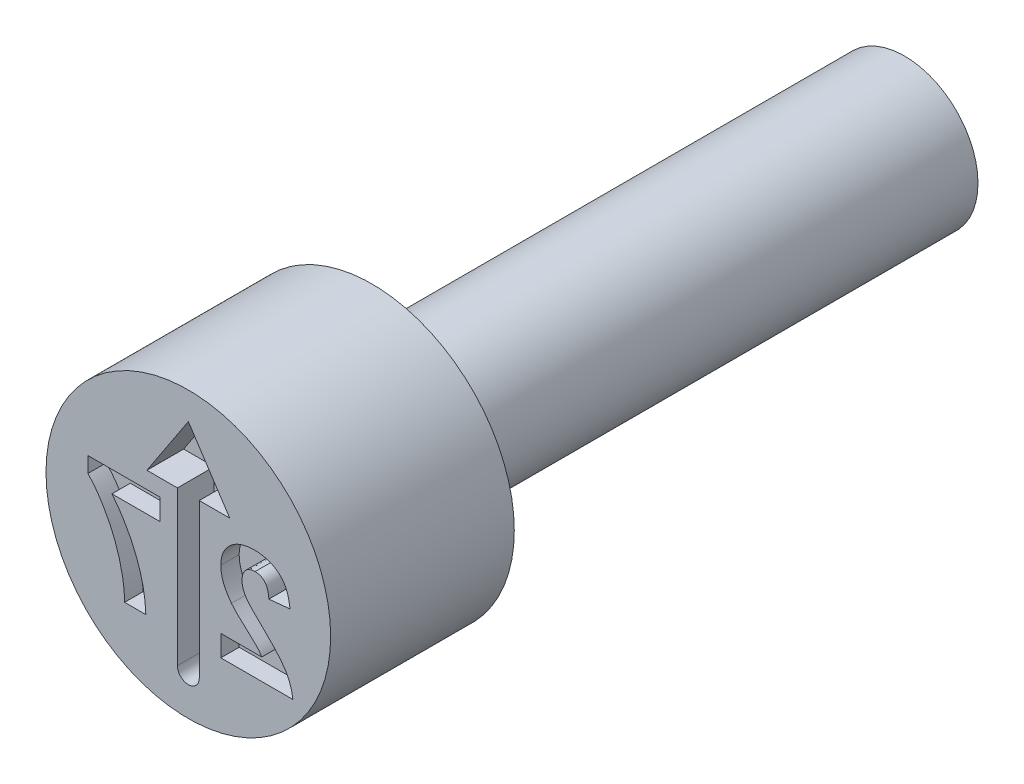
ISO-10303-21;
HEADER;
FILE_DESCRIPTION(('STEP AP214'),'2;1');
FILE_NAME('part.step','',(''),(''),'','','');
FILE_SCHEMA(('AUTOMOTIVE_DESIGN { 1 0 10303 214 1 1 1 1 }'));
ENDSEC;
DATA;
#1=APPLICATION_CONTEXT('core data for automotive mechanical design processes');
#2=APPLICATION_PROTOCOL_DEFINITION('international standard','automotive_design',2000,#1);
#3=PRODUCT_CONTEXT('',#1,'mechanical');
#4=PRODUCT('Part','Part','',(#3));
#5=PRODUCT_RELATED_PRODUCT_CATEGORY('part','',(#4));
#6=PRODUCT_DEFINITION_FORMATION('','',#4);
#7=PRODUCT_DEFINITION_CONTEXT('part definition',#1,'design');
#8=PRODUCT_DEFINITION('design','',#6,#7);
#9=PRODUCT_DEFINITION_SHAPE('','',#8);
#10=(LENGTH_UNIT() NAMED_UNIT(*) SI_UNIT(.MILLI.,.METRE.));
#11=(NAMED_UNIT(*) PLANE_ANGLE_UNIT() SI_UNIT($,.RADIAN.));
#12=(NAMED_UNIT(*) SI_UNIT($,.STERADIAN.) SOLID_ANGLE_UNIT());
#13=UNCERTAINTY_MEASURE_WITH_UNIT(LENGTH_MEASURE(1.E-05),#10,'distance_accuracy_value','');
#14=(GEOMETRIC_REPRESENTATION_CONTEXT(3) GLOBAL_UNCERTAINTY_ASSIGNED_CONTEXT((#13)) GLOBAL_UNIT_ASSIGNED_CONTEXT((#10,
#11,#12)) REPRESENTATION_CONTEXT('',''));
#15=CARTESIAN_POINT('',(0.,0.,0.));
#16=DIRECTION('',(0.,0.,1.));
#17=DIRECTION('',(1.,0.,0.));
#18=AXIS2_PLACEMENT_3D('',#15,#16,#17);
#19=CARTESIAN_POINT('',(0.,0.799999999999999,-2.));
#20=DIRECTION('',(0.,0.,1.));
#21=DIRECTION('',(1.,0.,0.));
#22=AXIS2_PLACEMENT_3D('',#19,#20,#21);
#23=PLANE('',#22);
#24=CARTESIAN_POINT('',(0.,0.,-2.));
#25=DIRECTION('',(0.,0.,1.));
#26=DIRECTION('',(1.,0.,0.));
#27=AXIS2_PLACEMENT_3D('',#24,#25,#26);
#28=CIRCLE('',#27,1.55);
#29=CARTESIAN_POINT('',(1.55,0.,-2.));
#30=VERTEX_POINT('',#29);
#31=EDGE_CURVE('E11',#30,#30,#28,.T.);
#32=ORIENTED_EDGE('',*,*,#31,.F.);
#33=EDGE_LOOP('',(#32));
#34=FACE_BOUND('',#33,.T.);
#35=CARTESIAN_POINT('',(0.,0.,-2.));
#36=DIRECTION('',(0.,0.,1.));
#37=DIRECTION('',(1.,0.,0.));
#38=AXIS2_PLACEMENT_3D('',#35,#36,#37);
#39=CIRCLE('',#38,0.799999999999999);
#40=CARTESIAN_POINT('',(0.799999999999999,0.,-2.));
#41=VERTEX_POINT('',#40);
#42=EDGE_CURVE('E462',#41,#41,#39,.T.);
#43=ORIENTED_EDGE('',*,*,#42,.T.);
#44=EDGE_LOOP('',(#43));
#45=FACE_BOUND('',#44,.T.);
#46=ADVANCED_FACE('F39',(#34,#45),#23,.F.);
#47=CARTESIAN_POINT('',(0.,0.,-0.403888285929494));
#48=DIRECTION('',(0.,0.,1.));
#49=DIRECTION('',(1.,0.,0.));
#50=AXIS2_PLACEMENT_3D('',#47,#48,#49);
#51=CYLINDRICAL_SURFACE('',#50,1.55);
#52=CARTESIAN_POINT('',(0.,0.,0.));
#53=DIRECTION('',(0.,0.,1.));
#54=DIRECTION('',(1.,0.,0.));
#55=AXIS2_PLACEMENT_3D('',#52,#53,#54);
#56=CIRCLE('',#55,1.55);
#57=CARTESIAN_POINT('',(1.55,0.,0.));
#58=VERTEX_POINT('',#57);
#59=EDGE_CURVE('E46',#58,#58,#56,.T.);
#60=ORIENTED_EDGE('',*,*,#59,.F.);
#61=EDGE_LOOP('',(#60));
#62=FACE_BOUND('',#61,.T.);
#63=ORIENTED_EDGE('',*,*,#31,.T.);
#64=EDGE_LOOP('',(#63));
#65=FACE_BOUND('',#64,.T.);
#66=ADVANCED_FACE('F484',(#62,#65),#51,.T.);
#67=CARTESIAN_POINT('',(0.,1.55,0.));
#68=DIRECTION('',(0.,0.,-1.));
#69=DIRECTION('',(-1.,0.,0.));
#70=AXIS2_PLACEMENT_3D('',#67,#68,#69);
#71=PLANE('',#70);
#72=DIRECTION('',(0.,1.,0.));
#73=VECTOR('',#72,1.);
#74=CARTESIAN_POINT('',(-0.308923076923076,0.153846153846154,0.));
#75=LINE('',#74,#73);
#76=CARTESIAN_POINT('',(-0.308923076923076,0.153846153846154,0.));
#77=VERTEX_POINT('',#76);
#78=CARTESIAN_POINT('',(-0.308923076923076,0.384615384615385,0.));
#79=VERTEX_POINT('',#78);
#80=EDGE_CURVE('E708',#77,#79,#75,.T.);
#81=ORIENTED_EDGE('',*,*,#80,.F.);
#82=DIRECTION('',(1.,0.,0.));
#83=VECTOR('',#82,1.);
#84=CARTESIAN_POINT('',(-0.832240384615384,0.153846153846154,0.));
#85=LINE('',#84,#83);
#86=CARTESIAN_POINT('',(-0.832240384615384,0.153846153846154,0.));
#87=VERTEX_POINT('',#86);
#88=EDGE_CURVE('E53',#87,#77,#85,.T.);
#89=ORIENTED_EDGE('',*,*,#88,.F.);
#90=CARTESIAN_POINT('',(-0.462769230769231,-0.8,0.));
#91=CARTESIAN_POINT('',(-0.463540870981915,-0.779556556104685,0.));
#92=CARTESIAN_POINT('',(-0.465092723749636,-0.738442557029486,0.));
#93=CARTESIAN_POINT('',(-0.470898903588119,-0.676731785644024,0.));
#94=CARTESIAN_POINT('',(-0.480018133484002,-0.61479123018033,0.));
#95=CARTESIAN_POINT('',(-0.491344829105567,-0.552477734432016,0.));
#96=CARTESIAN_POINT('',(-0.506298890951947,-0.489942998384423,0.));
#97=CARTESIAN_POINT('',(-0.523366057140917,-0.426955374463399,0.));
#98=CARTESIAN_POINT('',(-0.544040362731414,-0.363851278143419,0.));
#99=CARTESIAN_POINT('',(-0.567215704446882,-0.300751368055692,0.));
#100=CARTESIAN_POINT('',(-0.592800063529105,-0.238254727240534,0.));
#101=CARTESIAN_POINT('',(-0.620683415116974,-0.177136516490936,0.));
#102=CARTESIAN_POINT('',(-0.650793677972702,-0.117778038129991,0.));
#103=CARTESIAN_POINT('',(-0.682739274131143,-0.059970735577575,0.));
#104=CARTESIAN_POINT('',(-0.716891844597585,-0.00390057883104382,0.));
#105=CARTESIAN_POINT('',(-0.753277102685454,0.0503715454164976,0.));
#106=CARTESIAN_POINT('',(-0.791378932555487,0.103238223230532,0.));
#107=CARTESIAN_POINT('',(-0.818622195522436,0.136979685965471,0.));
#108=CARTESIAN_POINT('',(-0.832240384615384,0.153846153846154,0.));
#109=B_SPLINE_CURVE_WITH_KNOTS('',3,(#90,#91,#92,#93,#94,#95,#96,#97,#98,#99,#100,#101,#102,
#103,#104,#105,#106,#107,#108),.UNSPECIFIED.,.F.,.F.,(4,1,1,1,1,1,1,1,1,1,1,1,1,1,1,1,4),(0.,
0.0589531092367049,0.118561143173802,0.178522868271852,0.239353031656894,0.301026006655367,
0.363773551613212,0.427382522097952,0.492333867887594,0.557475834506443,0.621960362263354,
0.685889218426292,0.749254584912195,0.812267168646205,0.875035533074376,0.937533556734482,1.),.UNSPECIFIED.);
#110=CARTESIAN_POINT('',(-0.462769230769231,-0.8,0.));
#111=VERTEX_POINT('',#110);
#112=EDGE_CURVE('E238',#111,#87,#109,.T.);
#113=ORIENTED_EDGE('',*,*,#112,.F.);
#114=DIRECTION('',(1.,0.,0.));
#115=VECTOR('',#114,1.);
#116=CARTESIAN_POINT('',(-0.693538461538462,-0.8,0.));
#117=LINE('',#116,#115);
#118=CARTESIAN_POINT('',(-0.693538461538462,-0.8,0.));
#119=VERTEX_POINT('',#118);
#120=EDGE_CURVE('E241',#119,#111,#117,.T.);
#121=ORIENTED_EDGE('',*,*,#120,.F.);
#122=CARTESIAN_POINT('',(-1.09353846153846,0.215384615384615,0.));
#123=CARTESIAN_POINT('',(-1.08535344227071,0.207056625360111,0.));
#124=CARTESIAN_POINT('',(-1.06852739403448,0.189936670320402,0.));
#125=CARTESIAN_POINT('',(-1.04442572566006,0.161918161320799,0.));
#126=CARTESIAN_POINT('',(-1.01996695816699,0.131513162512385,0.));
#127=CARTESIAN_POINT('',(-0.995662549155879,0.0983119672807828,0.));
#128=CARTESIAN_POINT('',(-0.970757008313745,0.0628390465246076,0.));
#129=CARTESIAN_POINT('',(-0.94634484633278,0.0244144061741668,0.));
#130=CARTESIAN_POINT('',(-0.921585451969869,-0.0164634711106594,0.));
#131=CARTESIAN_POINT('',(-0.888251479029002,-0.0742853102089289,0.));
#132=CARTESIAN_POINT('',(-0.849288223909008,-0.14981849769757,0.));
#133=CARTESIAN_POINT('',(-0.808067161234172,-0.243710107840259,0.));
#134=CARTESIAN_POINT('',(-0.772948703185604,-0.340485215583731,0.));
#135=CARTESIAN_POINT('',(-0.748901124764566,-0.422944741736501,0.));
#136=CARTESIAN_POINT('',(-0.732653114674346,-0.489035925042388,0.));
#137=CARTESIAN_POINT('',(-0.722037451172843,-0.537363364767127,0.));
#138=CARTESIAN_POINT('',(-0.713101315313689,-0.584330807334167,0.));
#139=CARTESIAN_POINT('',(-0.70583177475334,-0.630020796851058,0.));
#140=CARTESIAN_POINT('',(-0.700406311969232,-0.67445417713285,0.));
#141=CARTESIAN_POINT('',(-0.696119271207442,-0.717476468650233,0.));
#142=CARTESIAN_POINT('',(-0.694004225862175,-0.759192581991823,0.));
#143=CARTESIAN_POINT('',(-0.693692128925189,-0.786536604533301,0.));
#144=CARTESIAN_POINT('',(-0.693538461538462,-0.8,0.));
#145=B_SPLINE_CURVE_WITH_KNOTS('',3,(#122,#123,#124,#125,#126,#127,#128,#129,#130,#131,#132,
#133,#134,#135,#136,#137,#138,#139,#140,#141,#142,#143,#144),.UNSPECIFIED.,.F.,.F.,(4,1,1,1,1,1,
1,1,1,1,1,1,1,1,1,1,1,1,1,1,4),(0.,0.0314272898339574,0.0646054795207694,0.0994393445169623,
0.136456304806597,0.175351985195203,0.216100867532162,0.258977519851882,0.304007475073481,
0.395756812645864,0.487615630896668,0.579873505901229,0.672707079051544,0.718694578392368,
0.76307923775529,0.805893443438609,0.847386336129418,0.88760014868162,0.926386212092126,
0.963754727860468,1.),.UNSPECIFIED.);
#146=CARTESIAN_POINT('',(-1.09353846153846,0.215384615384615,0.));
#147=VERTEX_POINT('',#146);
#148=EDGE_CURVE('E694',#147,#119,#145,.T.);
#149=ORIENTED_EDGE('',*,*,#148,.F.);
#150=DIRECTION('',(0.,-1.,0.));
#151=VECTOR('',#150,1.);
#152=CARTESIAN_POINT('',(-1.09353846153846,0.384615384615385,0.));
#153=LINE('',#152,#151);
#154=CARTESIAN_POINT('',(-1.09353846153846,0.384615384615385,0.));
#155=VERTEX_POINT('',#154);
#156=EDGE_CURVE('E699',#155,#147,#153,.T.);
#157=ORIENTED_EDGE('',*,*,#156,.F.);
#158=DIRECTION('',(-1.,0.,0.));
#159=VECTOR('',#158,1.);
#160=CARTESIAN_POINT('',(-0.308923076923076,0.384615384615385,0.));
#161=LINE('',#160,#159);
#162=EDGE_CURVE('E705',#79,#155,#161,.T.);
#163=ORIENTED_EDGE('',*,*,#162,.F.);
#164=EDGE_LOOP('',(#81,#89,#113,#121,#149,#157,#163));
#165=FACE_BOUND('',#164,.T.);
#166=DIRECTION('',(0.,-1.,0.));
#167=VECTOR('',#166,1.);
#168=CARTESIAN_POINT('',(0.353846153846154,-0.569230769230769,0.));
#169=LINE('',#168,#167);
#170=CARTESIAN_POINT('',(0.353846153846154,-0.569230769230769,0.));
#171=VERTEX_POINT('',#170);
#172=CARTESIAN_POINT('',(0.353846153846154,-0.8,0.));
#173=VERTEX_POINT('',#172);
#174=EDGE_CURVE('E310',#171,#173,#169,.T.);
#175=ORIENTED_EDGE('',*,*,#174,.F.);
#176=DIRECTION('',(-1.,0.,0.));
#177=VECTOR('',#176,1.);
#178=CARTESIAN_POINT('',(0.799759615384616,-0.569230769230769,0.));
#179=LINE('',#178,#177);
#180=CARTESIAN_POINT('',(0.799759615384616,-0.569230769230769,0.));
#181=VERTEX_POINT('',#180);
#182=EDGE_CURVE('E61',#181,#171,#179,.T.);
#183=ORIENTED_EDGE('',*,*,#182,.F.);
#184=CARTESIAN_POINT('',(0.470192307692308,-0.227403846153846,0.));
#185=CARTESIAN_POINT('',(0.473842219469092,-0.232000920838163,0.));
#186=CARTESIAN_POINT('',(0.48165948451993,-0.241846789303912,0.));
#187=CARTESIAN_POINT('',(0.494958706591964,-0.256943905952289,0.));
#188=CARTESIAN_POINT('',(0.510371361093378,-0.273434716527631,0.));
#189=CARTESIAN_POINT('',(0.527679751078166,-0.291627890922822,0.));
#190=CARTESIAN_POINT('',(0.547455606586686,-0.310879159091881,0.));
#191=CARTESIAN_POINT('',(0.568987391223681,-0.331993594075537,0.));
#192=CARTESIAN_POINT('',(0.593222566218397,-0.35389112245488,0.));
#193=CARTESIAN_POINT('',(0.618324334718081,-0.377117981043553,0.));
#194=CARTESIAN_POINT('',(0.64353521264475,-0.399724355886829,0.));
#195=CARTESIAN_POINT('',(0.666707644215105,-0.421195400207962,0.));
#196=CARTESIAN_POINT('',(0.687755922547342,-0.44019266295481,0.));
#197=CARTESIAN_POINT('',(0.705699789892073,-0.457764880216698,0.));
#198=CARTESIAN_POINT('',(0.721594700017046,-0.472712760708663,0.));
#199=CARTESIAN_POINT('',(0.734867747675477,-0.485802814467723,0.));
#200=CARTESIAN_POINT('',(0.745767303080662,-0.496718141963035,0.));
#201=CARTESIAN_POINT('',(0.760786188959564,-0.513732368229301,0.));
#202=CARTESIAN_POINT('',(0.779896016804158,-0.536744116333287,0.));
#203=CARTESIAN_POINT('',(0.793340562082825,-0.558732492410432,0.));
#204=CARTESIAN_POINT('',(0.799759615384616,-0.569230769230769,0.));
#205=B_SPLINE_CURVE_WITH_KNOTS('',3,(#184,#185,#186,#187,#188,#189,#190,#191,#192,#193,#194,
#195,#196,#197,#198,#199,#200,#201,#202,#203,#204),.UNSPECIFIED.,.F.,.F.,(4,1,1,1,1,1,1,1,1,1,1,
1,1,1,1,1,1,1,4),(0.,0.0369753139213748,0.0791925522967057,0.126700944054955,0.179184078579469,
0.237368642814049,0.300558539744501,0.369153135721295,0.443112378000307,0.516018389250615,
0.582473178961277,0.642136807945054,0.694619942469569,0.740679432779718,0.779589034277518,
0.812073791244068,0.837814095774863,0.922564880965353,1.),.UNSPECIFIED.);
#206=CARTESIAN_POINT('',(0.470192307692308,-0.227403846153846,0.));
#207=VERTEX_POINT('',#206);
#208=EDGE_CURVE('E381',#207,#181,#205,.T.);
#209=ORIENTED_EDGE('',*,*,#208,.F.);
#210=CARTESIAN_POINT('',(0.353846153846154,0.0735576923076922,0.));
#211=CARTESIAN_POINT('',(0.354139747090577,0.0604771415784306,0.));
#212=CARTESIAN_POINT('',(0.354722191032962,0.0345273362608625,0.));
#213=CARTESIAN_POINT('',(0.360298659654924,-0.00383422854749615,0.));
#214=CARTESIAN_POINT('',(0.368818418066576,-0.0413111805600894,0.));
#215=CARTESIAN_POINT('',(0.381409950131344,-0.0779951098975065,0.));
#216=CARTESIAN_POINT('',(0.397370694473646,-0.114765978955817,0.));
#217=CARTESIAN_POINT('',(0.417944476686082,-0.151706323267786,0.));
#218=CARTESIAN_POINT('',(0.441832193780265,-0.189930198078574,0.));
#219=CARTESIAN_POINT('',(0.46053533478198,-0.21464360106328,0.));
#220=CARTESIAN_POINT('',(0.470192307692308,-0.227403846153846,0.));
#221=B_SPLINE_CURVE_WITH_KNOTS('',3,(#210,#211,#212,#213,#214,#215,#216,#217,#218,#219,#220),
.UNSPECIFIED.,.F.,.F.,(4,1,1,1,1,1,1,1,4),(0.,0.119176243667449,0.236427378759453,
0.352663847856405,0.469086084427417,0.589462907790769,0.717601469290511,0.854189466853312,1.),.UNSPECIFIED.);
#222=CARTESIAN_POINT('',(0.353846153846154,0.0735576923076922,0.));
#223=VERTEX_POINT('',#222);
#224=EDGE_CURVE('E373',#223,#207,#221,.T.);
#225=ORIENTED_EDGE('',*,*,#224,.F.);
#226=CARTESIAN_POINT('',(0.722115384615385,0.4,0.));
#227=CARTESIAN_POINT('',(0.708162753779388,0.399731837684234,0.));
#228=CARTESIAN_POINT('',(0.680988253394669,0.399209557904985,0.));
#229=CARTESIAN_POINT('',(0.641318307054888,0.394896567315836,0.));
#230=CARTESIAN_POINT('',(0.604051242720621,0.387376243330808,0.));
#231=CARTESIAN_POINT('',(0.568861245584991,0.377414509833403,0.));
#232=CARTESIAN_POINT('',(0.536109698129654,0.364114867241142,0.));
#233=CARTESIAN_POINT('',(0.505523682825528,0.348036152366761,0.));
#234=CARTESIAN_POINT('',(0.477584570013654,0.32856814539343,0.));
#235=CARTESIAN_POINT('',(0.451875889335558,0.306772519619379,0.));
#236=CARTESIAN_POINT('',(0.428894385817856,0.282804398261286,0.));
#237=CARTESIAN_POINT('',(0.408764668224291,0.257238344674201,0.));
#238=CARTESIAN_POINT('',(0.391900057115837,0.230092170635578,0.));
#239=CARTESIAN_POINT('',(0.37774805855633,0.201696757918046,0.));
#240=CARTESIAN_POINT('',(0.367240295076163,0.171595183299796,0.));
#241=CARTESIAN_POINT('',(0.35958388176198,0.140203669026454,0.));
#242=CARTESIAN_POINT('',(0.354507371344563,0.10737576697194,0.));
#243=CARTESIAN_POINT('',(0.354068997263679,0.0849550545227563,0.));
#244=CARTESIAN_POINT('',(0.353846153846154,0.0735576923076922,0.));
#245=B_SPLINE_CURVE_WITH_KNOTS('',3,(#226,#227,#228,#229,#230,#231,#232,#233,#234,#235,#236,
#237,#238,#239,#240,#241,#242,#243,#244),.UNSPECIFIED.,.F.,.F.,(4,1,1,1,1,1,1,1,1,1,1,1,1,1,1,1,
4),(0.,0.0756723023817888,0.147381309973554,0.216084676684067,0.28169803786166,
0.345459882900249,0.407485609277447,0.46873129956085,0.529782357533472,0.590032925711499,
0.648548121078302,0.70595351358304,0.763101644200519,0.820289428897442,0.878479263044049,
0.938226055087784,1.),.UNSPECIFIED.);
#246=CARTESIAN_POINT('',(0.722115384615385,0.4,0.));
#247=VERTEX_POINT('',#246);
#248=EDGE_CURVE('E365',#247,#223,#245,.T.);
#249=ORIENTED_EDGE('',*,*,#248,.F.);
#250=CARTESIAN_POINT('',(1.10769230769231,0.0379807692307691,0.));
#251=CARTESIAN_POINT('',(1.10583695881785,0.0535606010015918,0.));
#252=CARTESIAN_POINT('',(1.10223973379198,0.0837674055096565,0.));
#253=CARTESIAN_POINT('',(1.09326279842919,0.127154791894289,0.));
#254=CARTESIAN_POINT('',(1.08189384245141,0.167181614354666,0.));
#255=CARTESIAN_POINT('',(1.06759086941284,0.203773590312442,0.));
#256=CARTESIAN_POINT('',(1.05094503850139,0.23716340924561,0.));
#257=CARTESIAN_POINT('',(1.03110727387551,0.266850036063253,0.));
#258=CARTESIAN_POINT('',(1.00877072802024,0.293162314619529,0.));
#259=CARTESIAN_POINT('',(0.983916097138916,0.316086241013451,0.));
#260=CARTESIAN_POINT('',(0.956701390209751,0.335694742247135,0.));
#261=CARTESIAN_POINT('',(0.928144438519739,0.353198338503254,0.));
#262=CARTESIAN_POINT('',(0.897687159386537,0.36755685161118,0.));
#263=CARTESIAN_POINT('',(0.865664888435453,0.379390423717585,0.));
#264=CARTESIAN_POINT('',(0.832092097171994,0.388847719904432,0.));
#265=CARTESIAN_POINT('',(0.796813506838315,0.395100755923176,0.));
#266=CARTESIAN_POINT('',(0.760046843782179,0.399499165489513,0.));
#267=CARTESIAN_POINT('',(0.734949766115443,0.399830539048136,0.));
#268=CARTESIAN_POINT('',(0.722115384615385,0.4,0.));
#269=B_SPLINE_CURVE_WITH_KNOTS('',3,(#250,#251,#252,#253,#254,#255,#256,#257,#258,#259,#260,
#261,#262,#263,#264,#265,#266,#267,#268),.UNSPECIFIED.,.F.,.F.,(4,1,1,1,1,1,1,1,1,1,1,1,1,1,1,1,
4),(0.,0.0794357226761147,0.154013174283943,0.224141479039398,0.289934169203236,
0.352732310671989,0.412725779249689,0.470302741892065,0.527168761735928,0.583502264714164,
0.639948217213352,0.696584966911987,0.753726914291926,0.812707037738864,0.872963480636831,
0.93503486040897,1.),.UNSPECIFIED.);
#270=CARTESIAN_POINT('',(1.10769230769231,0.0379807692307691,0.));
#271=VERTEX_POINT('',#270);
#272=EDGE_CURVE('E360',#271,#247,#269,.T.);
#273=ORIENTED_EDGE('',*,*,#272,.F.);
#274=DIRECTION('',(0.995240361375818,0.0974506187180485,0.));
#275=VECTOR('',#274,1.);
#276=CARTESIAN_POINT('',(0.876923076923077,0.0153846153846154,0.));
#277=LINE('',#276,#275);
#278=CARTESIAN_POINT('',(0.876923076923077,0.0153846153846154,0.));
#279=VERTEX_POINT('',#278);
#280=EDGE_CURVE('E354',#279,#271,#277,.T.);
#281=ORIENTED_EDGE('',*,*,#280,.F.);
#282=CARTESIAN_POINT('',(0.726923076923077,0.2,0.));
#283=CARTESIAN_POINT('',(0.737389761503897,0.199525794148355,0.));
#284=CARTESIAN_POINT('',(0.757609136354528,0.198609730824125,0.));
#285=CARTESIAN_POINT('',(0.786345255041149,0.190607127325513,0.));
#286=CARTESIAN_POINT('',(0.811484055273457,0.176753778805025,0.));
#287=CARTESIAN_POINT('',(0.829399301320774,0.160966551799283,0.));
#288=CARTESIAN_POINT('',(0.841501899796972,0.145614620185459,0.));
#289=CARTESIAN_POINT('',(0.849748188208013,0.132236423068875,0.));
#290=CARTESIAN_POINT('',(0.856855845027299,0.117034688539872,0.));
#291=CARTESIAN_POINT('',(0.863153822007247,0.100180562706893,0.));
#292=CARTESIAN_POINT('',(0.868128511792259,0.0814809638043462,0.));
#293=CARTESIAN_POINT('',(0.872134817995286,0.0610783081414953,0.));
#294=CARTESIAN_POINT('',(0.875363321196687,0.038862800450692,0.));
#295=CARTESIAN_POINT('',(0.876390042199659,0.023408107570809,0.));
#296=CARTESIAN_POINT('',(0.876923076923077,0.0153846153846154,0.));
#297=B_SPLINE_CURVE_WITH_KNOTS('',3,(#282,#283,#284,#285,#286,#287,#288,#289,#290,#291,#292,
#293,#294,#295,#296),.UNSPECIFIED.,.F.,.F.,(4,1,1,1,1,1,1,1,1,1,1,1,4),(0.,0.116899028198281,
0.225823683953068,0.330086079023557,0.435451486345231,0.490306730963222,0.54824405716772,
0.610766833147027,0.677675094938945,0.749188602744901,0.826858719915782,0.910111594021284,1.),.UNSPECIFIED.);
#298=CARTESIAN_POINT('',(0.726923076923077,0.2,0.));
#299=VERTEX_POINT('',#298);
#300=EDGE_CURVE('E346',#299,#279,#297,.T.);
#301=ORIENTED_EDGE('',*,*,#300,.F.);
#302=CARTESIAN_POINT('',(0.584615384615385,0.0425480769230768,0.));
#303=CARTESIAN_POINT('',(0.585047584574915,0.0545209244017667,0.));
#304=CARTESIAN_POINT('',(0.585865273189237,0.0771726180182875,0.));
#305=CARTESIAN_POINT('',(0.592721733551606,0.109138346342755,0.));
#306=CARTESIAN_POINT('',(0.604880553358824,0.136617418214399,0.));
#307=CARTESIAN_POINT('',(0.621621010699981,0.159694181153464,0.));
#308=CARTESIAN_POINT('',(0.64278935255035,0.177774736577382,0.));
#309=CARTESIAN_POINT('',(0.667535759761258,0.1911345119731,0.));
#310=CARTESIAN_POINT('',(0.696222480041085,0.198520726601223,0.));
#311=CARTESIAN_POINT('',(0.716385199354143,0.1994922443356,0.));
#312=CARTESIAN_POINT('',(0.726923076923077,0.2,0.));
#313=B_SPLINE_CURVE_WITH_KNOTS('',3,(#302,#303,#304,#305,#306,#307,#308,#309,#310,#311,#312),
.UNSPECIFIED.,.F.,.F.,(4,1,1,1,1,1,1,1,4),(0.,0.149140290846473,0.282161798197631,
0.404655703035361,0.521109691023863,0.634416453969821,0.748796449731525,0.868710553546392,1.),.UNSPECIFIED.);
#314=CARTESIAN_POINT('',(0.584615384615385,0.0425480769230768,0.));
#315=VERTEX_POINT('',#314);
#316=EDGE_CURVE('E338',#315,#299,#313,.T.);
#317=ORIENTED_EDGE('',*,*,#316,.F.);
#318=CARTESIAN_POINT('',(0.630288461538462,-0.0961538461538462,0.));
#319=CARTESIAN_POINT('',(0.623340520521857,-0.0846125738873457,0.));
#320=CARTESIAN_POINT('',(0.609938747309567,-0.0623507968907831,0.));
#321=CARTESIAN_POINT('',(0.59524259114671,-0.027343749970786,0.));
#322=CARTESIAN_POINT('',(0.586421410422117,0.00765606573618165,0.));
#323=CARTESIAN_POINT('',(0.585210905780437,0.0310427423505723,0.));
#324=CARTESIAN_POINT('',(0.584615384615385,0.0425480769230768,0.));
#325=B_SPLINE_CURVE_WITH_KNOTS('',3,(#318,#319,#320,#321,#322,#323,#324),.UNSPECIFIED.,.F.,.F.,
(4,1,1,1,4),(0.,0.272795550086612,0.526191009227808,0.766904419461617,1.),.UNSPECIFIED.);
#326=CARTESIAN_POINT('',(0.630288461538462,-0.0961538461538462,0.));
#327=VERTEX_POINT('',#326);
#328=EDGE_CURVE('E330',#327,#315,#325,.T.);
#329=ORIENTED_EDGE('',*,*,#328,.F.);
#330=CARTESIAN_POINT('',(0.813942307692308,-0.289903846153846,0.));
#331=CARTESIAN_POINT('',(0.802077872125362,-0.278451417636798,0.));
#332=CARTESIAN_POINT('',(0.779491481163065,-0.256649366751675,0.));
#333=CARTESIAN_POINT('',(0.747328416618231,-0.225429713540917,0.));
#334=CARTESIAN_POINT('',(0.719053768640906,-0.196729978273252,0.));
#335=CARTESIAN_POINT('',(0.694076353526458,-0.171293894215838,0.));
#336=CARTESIAN_POINT('',(0.672973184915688,-0.148473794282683,0.));
#337=CARTESIAN_POINT('',(0.655466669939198,-0.128628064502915,0.));
#338=CARTESIAN_POINT('',(0.641335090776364,-0.111675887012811,0.));
#339=CARTESIAN_POINT('',(0.633681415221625,-0.100921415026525,0.));
#340=CARTESIAN_POINT('',(0.630288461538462,-0.0961538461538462,0.));
#341=B_SPLINE_CURVE_WITH_KNOTS('',3,(#330,#331,#332,#333,#334,#335,#336,#337,#338,#339,#340),
.UNSPECIFIED.,.F.,.F.,(4,1,1,1,1,1,1,1,4),(0.,0.18509006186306,0.352356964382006,
0.503079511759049,0.637279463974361,0.752473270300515,0.851885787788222,0.934339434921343,1.),.UNSPECIFIED.);
#342=CARTESIAN_POINT('',(0.813942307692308,-0.289903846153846,0.));
#343=VERTEX_POINT('',#342);
#344=EDGE_CURVE('E322',#343,#327,#341,.T.);
#345=ORIENTED_EDGE('',*,*,#344,.F.);
#346=CARTESIAN_POINT('',(1.13846153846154,-0.8,0.));
#347=CARTESIAN_POINT('',(1.1358050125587,-0.780277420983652,0.));
#348=CARTESIAN_POINT('',(1.13049345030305,-0.740843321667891,0.));
#349=CARTESIAN_POINT('',(1.11407199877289,-0.683240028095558,0.));
#350=CARTESIAN_POINT('',(1.09215498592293,-0.627029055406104,0.));
#351=CARTESIAN_POINT('',(1.06836823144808,-0.58128696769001,0.));
#352=CARTESIAN_POINT('',(1.04470966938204,-0.544466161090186,0.));
#353=CARTESIAN_POINT('',(1.02324425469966,-0.514294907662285,0.));
#354=CARTESIAN_POINT('',(0.997636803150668,-0.482193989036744,0.));
#355=CARTESIAN_POINT('',(0.968258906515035,-0.447904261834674,0.));
#356=CARTESIAN_POINT('',(0.93527291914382,-0.411318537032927,0.));
#357=CARTESIAN_POINT('',(0.898432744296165,-0.37257283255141,0.));
#358=CARTESIAN_POINT('',(0.85756264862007,-0.331852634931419,0.));
#359=CARTESIAN_POINT('',(0.828809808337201,-0.304201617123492,0.));
#360=CARTESIAN_POINT('',(0.813942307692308,-0.289903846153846,0.));
#361=B_SPLINE_CURVE_WITH_KNOTS('',3,(#346,#347,#348,#349,#350,#351,#352,#353,#354,#355,#356,
#357,#358,#359,#360),.UNSPECIFIED.,.F.,.F.,(4,1,1,1,1,1,1,1,1,1,1,1,4),(0.,0.0963574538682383,
0.192660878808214,0.289454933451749,0.388479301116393,0.441921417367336,0.501521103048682,
0.567882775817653,0.640891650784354,0.72037065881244,0.806636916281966,0.900015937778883,1.),.UNSPECIFIED.);
#362=CARTESIAN_POINT('',(1.13846153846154,-0.8,0.));
#363=VERTEX_POINT('',#362);
#364=EDGE_CURVE('E317',#363,#343,#361,.T.);
#365=ORIENTED_EDGE('',*,*,#364,.F.);
#366=DIRECTION('',(1.,0.,0.));
#367=VECTOR('',#366,1.);
#368=CARTESIAN_POINT('',(0.353846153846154,-0.8,0.));
#369=LINE('',#368,#367);
#370=EDGE_CURVE('E314',#173,#363,#369,.T.);
#371=ORIENTED_EDGE('',*,*,#370,.F.);
#372=EDGE_LOOP('',(#175,#183,#209,#225,#249,#273,#281,#301,#317,#329,#345,#365,#371));
#373=FACE_BOUND('',#372,.T.);
#374=DIRECTION('',(0.,1.,0.));
#375=VECTOR('',#374,1.);
#376=CARTESIAN_POINT('',(0.119045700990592,0.566469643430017,0.));
#377=LINE('',#376,#375);
#378=CARTESIAN_POINT('',(0.119045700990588,-1.11010114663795,0.));
#379=VERTEX_POINT('',#378);
#380=CARTESIAN_POINT('',(0.119045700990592,0.566469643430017,0.));
#381=VERTEX_POINT('',#380);
#382=EDGE_CURVE('E443',#379,#381,#377,.T.);
#383=ORIENTED_EDGE('',*,*,#382,.F.);
#384=CARTESIAN_POINT('',(1.02140308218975E-13,-1.11010114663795,0.));
#385=DIRECTION('',(0.,0.,1.));
#386=DIRECTION('',(1.,0.,0.));
#387=AXIS2_PLACEMENT_3D('',#384,#385,#386);
#388=CIRCLE('',#387,0.119045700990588);
#389=CARTESIAN_POINT('',(-0.119045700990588,-1.11010114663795,0.));
#390=VERTEX_POINT('',#389);
#391=EDGE_CURVE('E395',#390,#379,#388,.T.);
#392=ORIENTED_EDGE('',*,*,#391,.F.);
#393=DIRECTION('',(0.,-1.,0.));
#394=VECTOR('',#393,1.);
#395=CARTESIAN_POINT('',(-0.119045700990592,0.566469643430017,0.));
#396=LINE('',#395,#394);
#397=CARTESIAN_POINT('',(-0.119045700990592,0.566469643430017,0.));
#398=VERTEX_POINT('',#397);
#399=EDGE_CURVE('E423',#398,#390,#396,.T.);
#400=ORIENTED_EDGE('',*,*,#399,.F.);
#401=DIRECTION('',(1.,0.,0.));
#402=VECTOR('',#401,1.);
#403=CARTESIAN_POINT('',(-0.451198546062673,0.566469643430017,0.));
#404=LINE('',#403,#402);
#405=CARTESIAN_POINT('',(-0.451198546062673,0.566469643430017,0.));
#406=VERTEX_POINT('',#405);
#407=EDGE_CURVE('E455',#406,#398,#404,.T.);
#408=ORIENTED_EDGE('',*,*,#407,.F.);
#409=DIRECTION('',(-0.550159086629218,-0.835059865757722,0.));
#410=VECTOR('',#409,1.);
#411=CARTESIAN_POINT('',(0.,1.25132209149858,0.));
#412=LINE('',#411,#410);
#413=CARTESIAN_POINT('',(0.,1.25132209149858,0.));
#414=VERTEX_POINT('',#413);
#415=EDGE_CURVE('E452',#414,#406,#412,.T.);
#416=ORIENTED_EDGE('',*,*,#415,.F.);
#417=DIRECTION('',(-0.550159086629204,0.835059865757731,0.));
#418=VECTOR('',#417,1.);
#419=CARTESIAN_POINT('',(0.,1.25132209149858,0.));
#420=LINE('',#419,#418);
#421=CARTESIAN_POINT('',(0.451198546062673,0.566469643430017,0.));
#422=VERTEX_POINT('',#421);
#423=EDGE_CURVE('E449',#422,#414,#420,.T.);
#424=ORIENTED_EDGE('',*,*,#423,.F.);
#425=DIRECTION('',(1.,0.,0.));
#426=VECTOR('',#425,1.);
#427=CARTESIAN_POINT('',(0.451198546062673,0.566469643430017,0.));
#428=LINE('',#427,#426);
#429=EDGE_CURVE('E446',#381,#422,#428,.T.);
#430=ORIENTED_EDGE('',*,*,#429,.F.);
#431=EDGE_LOOP('',(#383,#392,#400,#408,#416,#424,#430));
#432=FACE_BOUND('',#431,.T.);
#433=ORIENTED_EDGE('',*,*,#59,.T.);
#434=EDGE_LOOP('',(#433));
#435=FACE_BOUND('',#434,.T.);
#436=ADVANCED_FACE('F482',(#165,#373,#432,#435),#71,.F.);
#437=CARTESIAN_POINT('',(0.,0.,-7.8));
#438=DIRECTION('',(0.,0.,1.));
#439=DIRECTION('',(1.,0.,0.));
#440=AXIS2_PLACEMENT_3D('',#437,#438,#439);
#441=PLANE('',#440);
#442=CARTESIAN_POINT('',(0.,0.,-7.8));
#443=DIRECTION('',(0.,0.,1.));
#444=DIRECTION('',(1.,0.,0.));
#445=AXIS2_PLACEMENT_3D('',#442,#443,#444);
#446=CIRCLE('',#445,0.799999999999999);
#447=CARTESIAN_POINT('',(0.799999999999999,0.,-7.8));
#448=VERTEX_POINT('',#447);
#449=EDGE_CURVE('E477',#448,#448,#446,.T.);
#450=ORIENTED_EDGE('',*,*,#449,.F.);
#451=EDGE_LOOP('',(#450));
#452=FACE_BOUND('',#451,.T.);
#453=ADVANCED_FACE('F497',(#452),#441,.F.);
#454=CARTESIAN_POINT('',(0.,0.,-0.403888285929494));
#455=DIRECTION('',(0.,0.,1.));
#456=DIRECTION('',(1.,0.,0.));
#457=AXIS2_PLACEMENT_3D('',#454,#455,#456);
#458=CYLINDRICAL_SURFACE('',#457,0.799999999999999);
#459=ORIENTED_EDGE('',*,*,#42,.F.);
#460=EDGE_LOOP('',(#459));
#461=FACE_BOUND('',#460,.T.);
#462=ORIENTED_EDGE('',*,*,#449,.T.);
#463=EDGE_LOOP('',(#462));
#464=FACE_BOUND('',#463,.T.);
#465=ADVANCED_FACE('F493',(#461,#464),#458,.T.);
#466=CARTESIAN_POINT('',(1.02140308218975E-13,-1.11010114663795,-0.4));
#467=DIRECTION('',(0.,0.,1.));
#468=DIRECTION('',(1.,0.,0.));
#469=AXIS2_PLACEMENT_3D('',#466,#467,#468);
#470=CYLINDRICAL_SURFACE('',#469,0.119045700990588);
#471=ORIENTED_EDGE('',*,*,#391,.T.);
#472=DIRECTION('',(0.,0.,1.));
#473=VECTOR('',#472,1.);
#474=CARTESIAN_POINT('',(0.119045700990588,-1.11010114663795,-0.4));
#475=LINE('',#474,#473);
#476=CARTESIAN_POINT('',(0.119045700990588,-1.11010114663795,-0.4));
#477=VERTEX_POINT('',#476);
#478=EDGE_CURVE('E441',#477,#379,#475,.T.);
#479=ORIENTED_EDGE('',*,*,#478,.F.);
#480=CARTESIAN_POINT('',(1.02140308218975E-13,-1.11010114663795,-0.4));
#481=DIRECTION('',(0.,0.,1.));
#482=DIRECTION('',(1.,0.,0.));
#483=AXIS2_PLACEMENT_3D('',#480,#481,#482);
#484=CIRCLE('',#483,0.119045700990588);
#485=CARTESIAN_POINT('',(-0.119045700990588,-1.11010114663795,-0.4));
#486=VERTEX_POINT('',#485);
#487=EDGE_CURVE('E419',#486,#477,#484,.T.);
#488=ORIENTED_EDGE('',*,*,#487,.F.);
#489=DIRECTION('',(0.,0.,1.));
#490=VECTOR('',#489,1.);
#491=CARTESIAN_POINT('',(-0.119045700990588,-1.11010114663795,-0.4));
#492=LINE('',#491,#490);
#493=EDGE_CURVE('E460',#486,#390,#492,.T.);
#494=ORIENTED_EDGE('',*,*,#493,.T.);
#495=EDGE_LOOP('',(#471,#479,#488,#494));
#496=FACE_BOUND('',#495,.T.);
#497=ADVANCED_FACE('F496',(#496),#470,.F.);
#498=CARTESIAN_POINT('',(-0.119045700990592,0.566469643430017,-0.4));
#499=DIRECTION('',(-1.,0.,0.));
#500=DIRECTION('',(0.,-1.,0.));
#501=AXIS2_PLACEMENT_3D('',#498,#499,#500);
#502=PLANE('',#501);
#503=ORIENTED_EDGE('',*,*,#399,.T.);
#504=ORIENTED_EDGE('',*,*,#493,.F.);
#505=DIRECTION('',(0.,-1.,0.));
#506=VECTOR('',#505,1.);
#507=CARTESIAN_POINT('',(-0.119045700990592,0.566469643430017,-0.4));
#508=LINE('',#507,#506);
#509=CARTESIAN_POINT('',(-0.119045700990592,0.566469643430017,-0.4));
#510=VERTEX_POINT('',#509);
#511=EDGE_CURVE('E438',#510,#486,#508,.T.);
#512=ORIENTED_EDGE('',*,*,#511,.F.);
#513=DIRECTION('',(0.,0.,1.));
#514=VECTOR('',#513,1.);
#515=CARTESIAN_POINT('',(-0.119045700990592,0.566469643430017,-0.4));
#516=LINE('',#515,#514);
#517=EDGE_CURVE('E463',#510,#398,#516,.T.);
#518=ORIENTED_EDGE('',*,*,#517,.T.);
#519=EDGE_LOOP('',(#503,#504,#512,#518));
#520=FACE_BOUND('',#519,.T.);
#521=ADVANCED_FACE('F511',(#520),#502,.F.);
#522=CARTESIAN_POINT('',(-0.451198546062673,0.566469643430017,-0.4));
#523=DIRECTION('',(0.,-1.,0.));
#524=DIRECTION('',(0.,0.,-1.));
#525=AXIS2_PLACEMENT_3D('',#522,#523,#524);
#526=PLANE('',#525);
#527=ORIENTED_EDGE('',*,*,#407,.T.);
#528=ORIENTED_EDGE('',*,*,#517,.F.);
#529=DIRECTION('',(1.,0.,0.));
#530=VECTOR('',#529,1.);
#531=CARTESIAN_POINT('',(-0.451198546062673,0.566469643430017,-0.4));
#532=LINE('',#531,#530);
#533=CARTESIAN_POINT('',(-0.451198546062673,0.566469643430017,-0.4));
#534=VERTEX_POINT('',#533);
#535=EDGE_CURVE('E435',#534,#510,#532,.T.);
#536=ORIENTED_EDGE('',*,*,#535,.F.);
#537=DIRECTION('',(0.,0.,1.));
#538=VECTOR('',#537,1.);
#539=CARTESIAN_POINT('',(-0.451198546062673,0.566469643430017,-0.4));
#540=LINE('',#539,#538);
#541=EDGE_CURVE('E465',#534,#406,#540,.T.);
#542=ORIENTED_EDGE('',*,*,#541,.T.);
#543=EDGE_LOOP('',(#527,#528,#536,#542));
#544=FACE_BOUND('',#543,.T.);
#545=ADVANCED_FACE('F529',(#544),#526,.F.);
#546=CARTESIAN_POINT('',(0.,1.25132209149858,-0.4));
#547=DIRECTION('',(-0.835059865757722,0.550159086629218,0.));
#548=DIRECTION('',(-0.550159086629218,-0.835059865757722,0.));
#549=AXIS2_PLACEMENT_3D('',#546,#547,#548);
#550=PLANE('',#549);
#551=ORIENTED_EDGE('',*,*,#415,.T.);
#552=ORIENTED_EDGE('',*,*,#541,.F.);
#553=DIRECTION('',(-0.550159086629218,-0.835059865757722,0.));
#554=VECTOR('',#553,1.);
#555=CARTESIAN_POINT('',(0.,1.25132209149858,-0.4));
#556=LINE('',#555,#554);
#557=CARTESIAN_POINT('',(0.,1.25132209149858,-0.4));
#558=VERTEX_POINT('',#557);
#559=EDGE_CURVE('E432',#558,#534,#556,.T.);
#560=ORIENTED_EDGE('',*,*,#559,.F.);
#561=DIRECTION('',(0.,0.,1.));
#562=VECTOR('',#561,1.);
#563=CARTESIAN_POINT('',(0.,1.25132209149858,-0.4));
#564=LINE('',#563,#562);
#565=EDGE_CURVE('E467',#558,#414,#564,.T.);
#566=ORIENTED_EDGE('',*,*,#565,.T.);
#567=EDGE_LOOP('',(#551,#552,#560,#566));
#568=FACE_BOUND('',#567,.T.);
#569=ADVANCED_FACE('F525',(#568),#550,.F.);
#570=CARTESIAN_POINT('',(0.,1.25132209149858,-0.4));
#571=DIRECTION('',(0.835059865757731,0.550159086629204,0.));
#572=DIRECTION('',(-0.550159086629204,0.835059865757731,0.));
#573=AXIS2_PLACEMENT_3D('',#570,#571,#572);
#574=PLANE('',#573);
#575=ORIENTED_EDGE('',*,*,#423,.T.);
#576=ORIENTED_EDGE('',*,*,#565,.F.);
#577=DIRECTION('',(-0.550159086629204,0.835059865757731,0.));
#578=VECTOR('',#577,1.);
#579=CARTESIAN_POINT('',(0.,1.25132209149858,-0.4));
#580=LINE('',#579,#578);
#581=CARTESIAN_POINT('',(0.451198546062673,0.566469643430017,-0.4));
#582=VERTEX_POINT('',#581);
#583=EDGE_CURVE('E429',#582,#558,#580,.T.);
#584=ORIENTED_EDGE('',*,*,#583,.F.);
#585=DIRECTION('',(0.,0.,1.));
#586=VECTOR('',#585,1.);
#587=CARTESIAN_POINT('',(0.451198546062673,0.566469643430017,-0.4));
#588=LINE('',#587,#586);
#589=EDGE_CURVE('E469',#582,#422,#588,.T.);
#590=ORIENTED_EDGE('',*,*,#589,.T.);
#591=EDGE_LOOP('',(#575,#576,#584,#590));
#592=FACE_BOUND('',#591,.T.);
#593=ADVANCED_FACE('F521',(#592),#574,.F.);
#594=CARTESIAN_POINT('',(0.451198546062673,0.566469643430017,-0.4));
#595=DIRECTION('',(0.,-1.,0.));
#596=DIRECTION('',(0.,0.,-1.));
#597=AXIS2_PLACEMENT_3D('',#594,#595,#596);
#598=PLANE('',#597);
#599=ORIENTED_EDGE('',*,*,#429,.T.);
#600=ORIENTED_EDGE('',*,*,#589,.F.);
#601=DIRECTION('',(1.,0.,0.));
#602=VECTOR('',#601,1.);
#603=CARTESIAN_POINT('',(0.451198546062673,0.566469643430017,-0.4));
#604=LINE('',#603,#602);
#605=CARTESIAN_POINT('',(0.119045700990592,0.566469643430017,-0.4));
#606=VERTEX_POINT('',#605);
#607=EDGE_CURVE('E426',#606,#582,#604,.T.);
#608=ORIENTED_EDGE('',*,*,#607,.F.);
#609=DIRECTION('',(0.,0.,1.));
#610=VECTOR('',#609,1.);
#611=CARTESIAN_POINT('',(0.119045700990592,0.566469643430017,-0.4));
#612=LINE('',#611,#610);
#613=EDGE_CURVE('E471',#606,#381,#612,.T.);
#614=ORIENTED_EDGE('',*,*,#613,.T.);
#615=EDGE_LOOP('',(#599,#600,#608,#614));
#616=FACE_BOUND('',#615,.T.);
#617=ADVANCED_FACE('F517',(#616),#598,.F.);
#618=CARTESIAN_POINT('',(0.119045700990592,0.566469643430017,-0.4));
#619=DIRECTION('',(1.,0.,0.));
#620=DIRECTION('',(0.,1.,0.));
#621=AXIS2_PLACEMENT_3D('',#618,#619,#620);
#622=PLANE('',#621);
#623=ORIENTED_EDGE('',*,*,#382,.T.);
#624=ORIENTED_EDGE('',*,*,#613,.F.);
#625=DIRECTION('',(0.,1.,0.));
#626=VECTOR('',#625,1.);
#627=CARTESIAN_POINT('',(0.119045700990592,0.566469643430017,-0.4));
#628=LINE('',#627,#626);
#629=EDGE_CURVE('E422',#477,#606,#628,.T.);
#630=ORIENTED_EDGE('',*,*,#629,.F.);
#631=ORIENTED_EDGE('',*,*,#478,.T.);
#632=EDGE_LOOP('',(#623,#624,#630,#631));
#633=FACE_BOUND('',#632,.T.);
#634=ADVANCED_FACE('F513',(#633),#622,.F.);
#635=CARTESIAN_POINT('',(1.02140308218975E-13,-1.11010114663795,-0.4));
#636=DIRECTION('',(0.,0.,1.));
#637=DIRECTION('',(1.,0.,0.));
#638=AXIS2_PLACEMENT_3D('',#635,#636,#637);
#639=PLANE('',#638);
#640=ORIENTED_EDGE('',*,*,#487,.T.);
#641=ORIENTED_EDGE('',*,*,#629,.T.);
#642=ORIENTED_EDGE('',*,*,#607,.T.);
#643=ORIENTED_EDGE('',*,*,#583,.T.);
#644=ORIENTED_EDGE('',*,*,#559,.T.);
#645=ORIENTED_EDGE('',*,*,#535,.T.);
#646=ORIENTED_EDGE('',*,*,#511,.T.);
#647=EDGE_LOOP('',(#640,#641,#642,#643,#644,#645,#646));
#648=FACE_BOUND('',#647,.T.);
#649=ADVANCED_FACE('F516',(#648),#639,.T.);
#650=CARTESIAN_POINT('',(0.799759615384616,-0.569230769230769,-0.2));
#651=DIRECTION('',(0.,1.,0.));
#652=DIRECTION('',(0.,0.,1.));
#653=AXIS2_PLACEMENT_3D('',#650,#651,#652);
#654=PLANE('',#653);
#655=ORIENTED_EDGE('',*,*,#182,.T.);
#656=DIRECTION('',(0.,0.,1.));
#657=VECTOR('',#656,1.);
#658=CARTESIAN_POINT('',(0.353846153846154,-0.569230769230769,-0.2));
#659=LINE('',#658,#657);
#660=CARTESIAN_POINT('',(0.353846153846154,-0.569230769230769,-0.2));
#661=VERTEX_POINT('',#660);
#662=EDGE_CURVE('E300',#661,#171,#659,.T.);
#663=ORIENTED_EDGE('',*,*,#662,.F.);
#664=DIRECTION('',(-1.,0.,0.));
#665=VECTOR('',#664,1.);
#666=CARTESIAN_POINT('',(0.799759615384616,-0.569230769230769,-0.2));
#667=LINE('',#666,#665);
#668=CARTESIAN_POINT('',(0.799759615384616,-0.569230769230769,-0.2));
#669=VERTEX_POINT('',#668);
#670=EDGE_CURVE('E389',#669,#661,#667,.T.);
#671=ORIENTED_EDGE('',*,*,#670,.F.);
#672=DIRECTION('',(0.,0.,1.));
#673=VECTOR('',#672,1.);
#674=CARTESIAN_POINT('',(0.799759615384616,-0.569230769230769,-0.2));
#675=LINE('',#674,#673);
#676=EDGE_CURVE('E390',#669,#181,#675,.T.);
#677=ORIENTED_EDGE('',*,*,#676,.T.);
#678=EDGE_LOOP('',(#655,#663,#671,#677));
#679=FACE_BOUND('',#678,.T.);
#680=ADVANCED_FACE('F290',(#679),#654,.F.);
#681=CARTESIAN_POINT('',(0.470192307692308,-0.227403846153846,-0.2));
#682=CARTESIAN_POINT('',(0.473842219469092,-0.232000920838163,-0.2));
#683=CARTESIAN_POINT('',(0.48165948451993,-0.241846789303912,-0.2));
#684=CARTESIAN_POINT('',(0.494958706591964,-0.256943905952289,-0.2));
#685=CARTESIAN_POINT('',(0.510371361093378,-0.273434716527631,-0.2));
#686=CARTESIAN_POINT('',(0.527679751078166,-0.291627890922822,-0.2));
#687=CARTESIAN_POINT('',(0.547455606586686,-0.310879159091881,-0.2));
#688=CARTESIAN_POINT('',(0.568987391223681,-0.331993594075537,-0.2));
#689=CARTESIAN_POINT('',(0.593222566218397,-0.35389112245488,-0.2));
#690=CARTESIAN_POINT('',(0.618324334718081,-0.377117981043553,-0.2));
#691=CARTESIAN_POINT('',(0.64353521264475,-0.399724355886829,-0.2));
#692=CARTESIAN_POINT('',(0.666707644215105,-0.421195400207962,-0.2));
#693=CARTESIAN_POINT('',(0.687755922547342,-0.44019266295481,-0.2));
#694=CARTESIAN_POINT('',(0.705699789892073,-0.457764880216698,-0.2));
#695=CARTESIAN_POINT('',(0.721594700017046,-0.472712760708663,-0.2));
#696=CARTESIAN_POINT('',(0.734867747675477,-0.485802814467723,-0.2));
#697=CARTESIAN_POINT('',(0.745767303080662,-0.496718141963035,-0.2));
#698=CARTESIAN_POINT('',(0.760786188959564,-0.513732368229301,-0.2));
#699=CARTESIAN_POINT('',(0.779896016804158,-0.536744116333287,-0.2));
#700=CARTESIAN_POINT('',(0.793340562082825,-0.558732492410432,-0.2));
#701=CARTESIAN_POINT('',(0.799759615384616,-0.569230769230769,-0.2));
#702=B_SPLINE_CURVE_WITH_KNOTS('',3,(#681,#682,#683,#684,#685,#686,#687,#688,#689,#690,#691,
#692,#693,#694,#695,#696,#697,#698,#699,#700,#701),.UNSPECIFIED.,.F.,.F.,(4,1,1,1,1,1,1,1,1,1,1,
1,1,1,1,1,1,1,4),(0.,0.0369753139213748,0.0791925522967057,0.126700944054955,0.179184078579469,
0.237368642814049,0.300558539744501,0.369153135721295,0.443112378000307,0.516018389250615,
0.582473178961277,0.642136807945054,0.694619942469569,0.740679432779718,0.779589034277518,
0.812073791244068,0.837814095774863,0.922564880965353,1.),.UNSPECIFIED.);
#703=DIRECTION('',(0.,0.,1.));
#704=VECTOR('',#703,1.);
#705=SURFACE_OF_LINEAR_EXTRUSION('',#702,#704);
#706=ORIENTED_EDGE('',*,*,#208,.T.);
#707=ORIENTED_EDGE('',*,*,#676,.F.);
#708=CARTESIAN_POINT('',(0.470192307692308,-0.227403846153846,-0.2));
#709=VERTEX_POINT('',#708);
#710=EDGE_CURVE('E294',#709,#669,#702,.T.);
#711=ORIENTED_EDGE('',*,*,#710,.F.);
#712=DIRECTION('',(0.,0.,1.));
#713=VECTOR('',#712,1.);
#714=CARTESIAN_POINT('',(0.470192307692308,-0.227403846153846,-0.2));
#715=LINE('',#714,#713);
#716=EDGE_CURVE('E396',#709,#207,#715,.T.);
#717=ORIENTED_EDGE('',*,*,#716,.T.);
#718=EDGE_LOOP('',(#706,#707,#711,#717));
#719=FACE_BOUND('',#718,.T.);
#720=ADVANCED_FACE('F285',(#719),#705,.F.);
#721=CARTESIAN_POINT('',(0.353846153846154,0.0735576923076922,-0.2));
#722=CARTESIAN_POINT('',(0.354139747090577,0.0604771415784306,-0.2));
#723=CARTESIAN_POINT('',(0.354722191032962,0.0345273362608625,-0.2));
#724=CARTESIAN_POINT('',(0.360298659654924,-0.00383422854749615,-0.2));
#725=CARTESIAN_POINT('',(0.368818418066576,-0.0413111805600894,-0.2));
#726=CARTESIAN_POINT('',(0.381409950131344,-0.0779951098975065,-0.2));
#727=CARTESIAN_POINT('',(0.397370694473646,-0.114765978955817,-0.2));
#728=CARTESIAN_POINT('',(0.417944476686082,-0.151706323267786,-0.2));
#729=CARTESIAN_POINT('',(0.441832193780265,-0.189930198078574,-0.2));
#730=CARTESIAN_POINT('',(0.46053533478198,-0.21464360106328,-0.2));
#731=CARTESIAN_POINT('',(0.470192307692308,-0.227403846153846,-0.2));
#732=B_SPLINE_CURVE_WITH_KNOTS('',3,(#721,#722,#723,#724,#725,#726,#727,#728,#729,#730,#731),
.UNSPECIFIED.,.F.,.F.,(4,1,1,1,1,1,1,1,4),(0.,0.119176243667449,0.236427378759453,
0.352663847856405,0.469086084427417,0.589462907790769,0.717601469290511,0.854189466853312,1.),.UNSPECIFIED.);
#733=DIRECTION('',(0.,0.,1.));
#734=VECTOR('',#733,1.);
#735=SURFACE_OF_LINEAR_EXTRUSION('',#732,#734);
#736=ORIENTED_EDGE('',*,*,#224,.T.);
#737=ORIENTED_EDGE('',*,*,#716,.F.);
#738=CARTESIAN_POINT('',(0.353846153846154,0.0735576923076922,-0.2));
#739=VERTEX_POINT('',#738);
#740=EDGE_CURVE('E301',#739,#709,#732,.T.);
#741=ORIENTED_EDGE('',*,*,#740,.F.);
#742=DIRECTION('',(0.,0.,1.));
#743=VECTOR('',#742,1.);
#744=CARTESIAN_POINT('',(0.353846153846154,0.0735576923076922,-0.2));
#745=LINE('',#744,#743);
#746=EDGE_CURVE('E398',#739,#223,#745,.T.);
#747=ORIENTED_EDGE('',*,*,#746,.T.);
#748=EDGE_LOOP('',(#736,#737,#741,#747));
#749=FACE_BOUND('',#748,.T.);
#750=ADVANCED_FACE('F289',(#749),#735,.F.);
#751=CARTESIAN_POINT('',(0.722115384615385,0.4,-0.2));
#752=CARTESIAN_POINT('',(0.708162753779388,0.399731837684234,-0.2));
#753=CARTESIAN_POINT('',(0.680988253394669,0.399209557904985,-0.2));
#754=CARTESIAN_POINT('',(0.641318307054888,0.394896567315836,-0.2));
#755=CARTESIAN_POINT('',(0.604051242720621,0.387376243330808,-0.2));
#756=CARTESIAN_POINT('',(0.568861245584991,0.377414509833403,-0.2));
#757=CARTESIAN_POINT('',(0.536109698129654,0.364114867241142,-0.2));
#758=CARTESIAN_POINT('',(0.505523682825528,0.348036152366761,-0.2));
#759=CARTESIAN_POINT('',(0.477584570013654,0.32856814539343,-0.2));
#760=CARTESIAN_POINT('',(0.451875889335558,0.306772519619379,-0.2));
#761=CARTESIAN_POINT('',(0.428894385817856,0.282804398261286,-0.2));
#762=CARTESIAN_POINT('',(0.408764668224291,0.257238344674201,-0.2));
#763=CARTESIAN_POINT('',(0.391900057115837,0.230092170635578,-0.2));
#764=CARTESIAN_POINT('',(0.37774805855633,0.201696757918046,-0.2));
#765=CARTESIAN_POINT('',(0.367240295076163,0.171595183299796,-0.2));
#766=CARTESIAN_POINT('',(0.35958388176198,0.140203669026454,-0.2));
#767=CARTESIAN_POINT('',(0.354507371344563,0.10737576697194,-0.2));
#768=CARTESIAN_POINT('',(0.354068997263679,0.0849550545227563,-0.2));
#769=CARTESIAN_POINT('',(0.353846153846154,0.0735576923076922,-0.2));
#770=B_SPLINE_CURVE_WITH_KNOTS('',3,(#751,#752,#753,#754,#755,#756,#757,#758,#759,#760,#761,
#762,#763,#764,#765,#766,#767,#768,#769),.UNSPECIFIED.,.F.,.F.,(4,1,1,1,1,1,1,1,1,1,1,1,1,1,1,1,
4),(0.,0.0756723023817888,0.147381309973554,0.216084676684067,0.28169803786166,
0.345459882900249,0.407485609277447,0.46873129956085,0.529782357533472,0.590032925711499,
0.648548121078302,0.70595351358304,0.763101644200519,0.820289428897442,0.878479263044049,
0.938226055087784,1.),.UNSPECIFIED.);
#771=DIRECTION('',(0.,0.,1.));
#772=VECTOR('',#771,1.);
#773=SURFACE_OF_LINEAR_EXTRUSION('',#770,#772);
#774=ORIENTED_EDGE('',*,*,#248,.T.);
#775=ORIENTED_EDGE('',*,*,#746,.F.);
#776=CARTESIAN_POINT('',(0.722115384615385,0.4,-0.2));
#777=VERTEX_POINT('',#776);
#778=EDGE_CURVE('E622',#777,#739,#770,.T.);
#779=ORIENTED_EDGE('',*,*,#778,.F.);
#780=DIRECTION('',(0.,0.,1.));
#781=VECTOR('',#780,1.);
#782=CARTESIAN_POINT('',(0.722115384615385,0.4,-0.2));
#783=LINE('',#782,#781);
#784=EDGE_CURVE('E400',#777,#247,#783,.T.);
#785=ORIENTED_EDGE('',*,*,#784,.T.);
#786=EDGE_LOOP('',(#774,#775,#779,#785));
#787=FACE_BOUND('',#786,.T.);
#788=ADVANCED_FACE('F631',(#787),#773,.F.);
#789=CARTESIAN_POINT('',(1.10769230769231,0.0379807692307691,-0.2));
#790=CARTESIAN_POINT('',(1.10583695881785,0.0535606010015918,-0.2));
#791=CARTESIAN_POINT('',(1.10223973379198,0.0837674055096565,-0.2));
#792=CARTESIAN_POINT('',(1.09326279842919,0.127154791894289,-0.2));
#793=CARTESIAN_POINT('',(1.08189384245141,0.167181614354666,-0.2));
#794=CARTESIAN_POINT('',(1.06759086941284,0.203773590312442,-0.2));
#795=CARTESIAN_POINT('',(1.05094503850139,0.23716340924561,-0.2));
#796=CARTESIAN_POINT('',(1.03110727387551,0.266850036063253,-0.2));
#797=CARTESIAN_POINT('',(1.00877072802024,0.293162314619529,-0.2));
#798=CARTESIAN_POINT('',(0.983916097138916,0.316086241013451,-0.2));
#799=CARTESIAN_POINT('',(0.956701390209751,0.335694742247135,-0.2));
#800=CARTESIAN_POINT('',(0.928144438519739,0.353198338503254,-0.2));
#801=CARTESIAN_POINT('',(0.897687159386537,0.36755685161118,-0.2));
#802=CARTESIAN_POINT('',(0.865664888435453,0.379390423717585,-0.2));
#803=CARTESIAN_POINT('',(0.832092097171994,0.388847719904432,-0.2));
#804=CARTESIAN_POINT('',(0.796813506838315,0.395100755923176,-0.2));
#805=CARTESIAN_POINT('',(0.760046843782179,0.399499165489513,-0.2));
#806=CARTESIAN_POINT('',(0.734949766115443,0.399830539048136,-0.2));
#807=CARTESIAN_POINT('',(0.722115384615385,0.4,-0.2));
#808=B_SPLINE_CURVE_WITH_KNOTS('',3,(#789,#790,#791,#792,#793,#794,#795,#796,#797,#798,#799,
#800,#801,#802,#803,#804,#805,#806,#807),.UNSPECIFIED.,.F.,.F.,(4,1,1,1,1,1,1,1,1,1,1,1,1,1,1,1,
4),(0.,0.0794357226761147,0.154013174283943,0.224141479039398,0.289934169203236,
0.352732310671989,0.412725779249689,0.470302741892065,0.527168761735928,0.583502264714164,
0.639948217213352,0.696584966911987,0.753726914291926,0.812707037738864,0.872963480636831,
0.93503486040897,1.),.UNSPECIFIED.);
#809=DIRECTION('',(0.,0.,1.));
#810=VECTOR('',#809,1.);
#811=SURFACE_OF_LINEAR_EXTRUSION('',#808,#810);
#812=ORIENTED_EDGE('',*,*,#272,.T.);
#813=ORIENTED_EDGE('',*,*,#784,.F.);
#814=CARTESIAN_POINT('',(1.10769230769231,0.0379807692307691,-0.2));
#815=VERTEX_POINT('',#814);
#816=EDGE_CURVE('E617',#815,#777,#808,.T.);
#817=ORIENTED_EDGE('',*,*,#816,.F.);
#818=DIRECTION('',(0.,0.,1.));
#819=VECTOR('',#818,1.);
#820=CARTESIAN_POINT('',(1.10769230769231,0.0379807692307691,-0.2));
#821=LINE('',#820,#819);
#822=EDGE_CURVE('E402',#815,#271,#821,.T.);
#823=ORIENTED_EDGE('',*,*,#822,.T.);
#824=EDGE_LOOP('',(#812,#813,#817,#823));
#825=FACE_BOUND('',#824,.T.);
#826=ADVANCED_FACE('F629',(#825),#811,.F.);
#827=CARTESIAN_POINT('',(0.876923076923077,0.0153846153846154,-0.2));
#828=DIRECTION('',(0.0974506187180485,-0.995240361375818,0.));
#829=DIRECTION('',(0.995240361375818,0.0974506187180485,0.));
#830=AXIS2_PLACEMENT_3D('',#827,#828,#829);
#831=PLANE('',#830);
#832=ORIENTED_EDGE('',*,*,#280,.T.);
#833=ORIENTED_EDGE('',*,*,#822,.F.);
#834=DIRECTION('',(0.995240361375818,0.0974506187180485,0.));
#835=VECTOR('',#834,1.);
#836=CARTESIAN_POINT('',(0.876923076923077,0.0153846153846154,-0.2));
#837=LINE('',#836,#835);
#838=CARTESIAN_POINT('',(0.876923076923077,0.0153846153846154,-0.2));
#839=VERTEX_POINT('',#838);
#840=EDGE_CURVE('E611',#839,#815,#837,.T.);
#841=ORIENTED_EDGE('',*,*,#840,.F.);
#842=DIRECTION('',(0.,0.,1.));
#843=VECTOR('',#842,1.);
#844=CARTESIAN_POINT('',(0.876923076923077,0.0153846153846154,-0.2));
#845=LINE('',#844,#843);
#846=EDGE_CURVE('E404',#839,#279,#845,.T.);
#847=ORIENTED_EDGE('',*,*,#846,.T.);
#848=EDGE_LOOP('',(#832,#833,#841,#847));
#849=FACE_BOUND('',#848,.T.);
#850=ADVANCED_FACE('F602',(#849),#831,.F.);
#851=CARTESIAN_POINT('',(0.726923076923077,0.2,-0.2));
#852=CARTESIAN_POINT('',(0.737389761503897,0.199525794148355,-0.2));
#853=CARTESIAN_POINT('',(0.757609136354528,0.198609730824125,-0.2));
#854=CARTESIAN_POINT('',(0.786345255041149,0.190607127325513,-0.2));
#855=CARTESIAN_POINT('',(0.811484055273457,0.176753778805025,-0.2));
#856=CARTESIAN_POINT('',(0.829399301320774,0.160966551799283,-0.2));
#857=CARTESIAN_POINT('',(0.841501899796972,0.145614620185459,-0.2));
#858=CARTESIAN_POINT('',(0.849748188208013,0.132236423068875,-0.2));
#859=CARTESIAN_POINT('',(0.856855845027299,0.117034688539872,-0.2));
#860=CARTESIAN_POINT('',(0.863153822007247,0.100180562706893,-0.2));
#861=CARTESIAN_POINT('',(0.868128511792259,0.0814809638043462,-0.2));
#862=CARTESIAN_POINT('',(0.872134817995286,0.0610783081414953,-0.2));
#863=CARTESIAN_POINT('',(0.875363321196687,0.038862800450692,-0.2));
#864=CARTESIAN_POINT('',(0.876390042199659,0.023408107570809,-0.2));
#865=CARTESIAN_POINT('',(0.876923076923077,0.0153846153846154,-0.2));
#866=B_SPLINE_CURVE_WITH_KNOTS('',3,(#851,#852,#853,#854,#855,#856,#857,#858,#859,#860,#861,
#862,#863,#864,#865),.UNSPECIFIED.,.F.,.F.,(4,1,1,1,1,1,1,1,1,1,1,1,4),(0.,0.116899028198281,
0.225823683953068,0.330086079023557,0.435451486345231,0.490306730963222,0.54824405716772,
0.610766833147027,0.677675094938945,0.749188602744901,0.826858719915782,0.910111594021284,1.),.UNSPECIFIED.);
#867=DIRECTION('',(0.,0.,1.));
#868=VECTOR('',#867,1.);
#869=SURFACE_OF_LINEAR_EXTRUSION('',#866,#868);
#870=ORIENTED_EDGE('',*,*,#300,.T.);
#871=ORIENTED_EDGE('',*,*,#846,.F.);
#872=CARTESIAN_POINT('',(0.726923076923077,0.2,-0.2));
#873=VERTEX_POINT('',#872);
#874=EDGE_CURVE('E605',#873,#839,#866,.T.);
#875=ORIENTED_EDGE('',*,*,#874,.F.);
#876=DIRECTION('',(0.,0.,1.));
#877=VECTOR('',#876,1.);
#878=CARTESIAN_POINT('',(0.726923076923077,0.2,-0.2));
#879=LINE('',#878,#877);
#880=EDGE_CURVE('E406',#873,#299,#879,.T.);
#881=ORIENTED_EDGE('',*,*,#880,.T.);
#882=EDGE_LOOP('',(#870,#871,#875,#881));
#883=FACE_BOUND('',#882,.T.);
#884=ADVANCED_FACE('F598',(#883),#869,.F.);
#885=CARTESIAN_POINT('',(0.584615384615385,0.0425480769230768,-0.2));
#886=CARTESIAN_POINT('',(0.585047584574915,0.0545209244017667,-0.2));
#887=CARTESIAN_POINT('',(0.585865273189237,0.0771726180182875,-0.2));
#888=CARTESIAN_POINT('',(0.592721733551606,0.109138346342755,-0.2));
#889=CARTESIAN_POINT('',(0.604880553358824,0.136617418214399,-0.2));
#890=CARTESIAN_POINT('',(0.621621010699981,0.159694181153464,-0.2));
#891=CARTESIAN_POINT('',(0.64278935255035,0.177774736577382,-0.2));
#892=CARTESIAN_POINT('',(0.667535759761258,0.1911345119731,-0.2));
#893=CARTESIAN_POINT('',(0.696222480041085,0.198520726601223,-0.2));
#894=CARTESIAN_POINT('',(0.716385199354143,0.1994922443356,-0.2));
#895=CARTESIAN_POINT('',(0.726923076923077,0.2,-0.2));
#896=B_SPLINE_CURVE_WITH_KNOTS('',3,(#885,#886,#887,#888,#889,#890,#891,#892,#893,#894,#895),
.UNSPECIFIED.,.F.,.F.,(4,1,1,1,1,1,1,1,4),(0.,0.149140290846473,0.282161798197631,
0.404655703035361,0.521109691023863,0.634416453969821,0.748796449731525,0.868710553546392,1.),.UNSPECIFIED.);
#897=DIRECTION('',(0.,0.,1.));
#898=VECTOR('',#897,1.);
#899=SURFACE_OF_LINEAR_EXTRUSION('',#896,#898);
#900=ORIENTED_EDGE('',*,*,#316,.T.);
#901=ORIENTED_EDGE('',*,*,#880,.F.);
#902=CARTESIAN_POINT('',(0.584615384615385,0.0425480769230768,-0.2));
#903=VERTEX_POINT('',#902);
#904=EDGE_CURVE('E583',#903,#873,#896,.T.);
#905=ORIENTED_EDGE('',*,*,#904,.F.);
#906=DIRECTION('',(0.,0.,1.));
#907=VECTOR('',#906,1.);
#908=CARTESIAN_POINT('',(0.584615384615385,0.0425480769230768,-0.2));
#909=LINE('',#908,#907);
#910=EDGE_CURVE('E408',#903,#315,#909,.T.);
#911=ORIENTED_EDGE('',*,*,#910,.T.);
#912=EDGE_LOOP('',(#900,#901,#905,#911));
#913=FACE_BOUND('',#912,.T.);
#914=ADVANCED_FACE('F594',(#913),#899,.F.);
#915=CARTESIAN_POINT('',(0.630288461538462,-0.0961538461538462,-0.2));
#916=CARTESIAN_POINT('',(0.623340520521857,-0.0846125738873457,-0.2));
#917=CARTESIAN_POINT('',(0.609938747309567,-0.0623507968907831,-0.2));
#918=CARTESIAN_POINT('',(0.59524259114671,-0.027343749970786,-0.2));
#919=CARTESIAN_POINT('',(0.586421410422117,0.00765606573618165,-0.2));
#920=CARTESIAN_POINT('',(0.585210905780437,0.0310427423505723,-0.2));
#921=CARTESIAN_POINT('',(0.584615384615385,0.0425480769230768,-0.2));
#922=B_SPLINE_CURVE_WITH_KNOTS('',3,(#915,#916,#917,#918,#919,#920,#921),.UNSPECIFIED.,.F.,.F.,
(4,1,1,1,4),(0.,0.272795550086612,0.526191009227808,0.766904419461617,1.),.UNSPECIFIED.);
#923=DIRECTION('',(0.,0.,1.));
#924=VECTOR('',#923,1.);
#925=SURFACE_OF_LINEAR_EXTRUSION('',#922,#924);
#926=ORIENTED_EDGE('',*,*,#328,.T.);
#927=ORIENTED_EDGE('',*,*,#910,.F.);
#928=CARTESIAN_POINT('',(0.630288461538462,-0.0961538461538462,-0.2));
#929=VERTEX_POINT('',#928);
#930=EDGE_CURVE('E574',#929,#903,#922,.T.);
#931=ORIENTED_EDGE('',*,*,#930,.F.);
#932=DIRECTION('',(0.,0.,1.));
#933=VECTOR('',#932,1.);
#934=CARTESIAN_POINT('',(0.630288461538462,-0.0961538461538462,-0.2));
#935=LINE('',#934,#933);
#936=EDGE_CURVE('E410',#929,#327,#935,.T.);
#937=ORIENTED_EDGE('',*,*,#936,.T.);
#938=EDGE_LOOP('',(#926,#927,#931,#937));
#939=FACE_BOUND('',#938,.T.);
#940=ADVANCED_FACE('F591',(#939),#925,.F.);
#941=CARTESIAN_POINT('',(0.813942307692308,-0.289903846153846,-0.2));
#942=CARTESIAN_POINT('',(0.802077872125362,-0.278451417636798,-0.2));
#943=CARTESIAN_POINT('',(0.779491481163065,-0.256649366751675,-0.2));
#944=CARTESIAN_POINT('',(0.747328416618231,-0.225429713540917,-0.2));
#945=CARTESIAN_POINT('',(0.719053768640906,-0.196729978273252,-0.2));
#946=CARTESIAN_POINT('',(0.694076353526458,-0.171293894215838,-0.2));
#947=CARTESIAN_POINT('',(0.672973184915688,-0.148473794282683,-0.2));
#948=CARTESIAN_POINT('',(0.655466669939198,-0.128628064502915,-0.2));
#949=CARTESIAN_POINT('',(0.641335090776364,-0.111675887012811,-0.2));
#950=CARTESIAN_POINT('',(0.633681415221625,-0.100921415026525,-0.2));
#951=CARTESIAN_POINT('',(0.630288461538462,-0.0961538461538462,-0.2));
#952=B_SPLINE_CURVE_WITH_KNOTS('',3,(#941,#942,#943,#944,#945,#946,#947,#948,#949,#950,#951),
.UNSPECIFIED.,.F.,.F.,(4,1,1,1,1,1,1,1,4),(0.,0.18509006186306,0.352356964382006,
0.503079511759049,0.637279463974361,0.752473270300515,0.851885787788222,0.934339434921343,1.),.UNSPECIFIED.);
#953=DIRECTION('',(0.,0.,1.));
#954=VECTOR('',#953,1.);
#955=SURFACE_OF_LINEAR_EXTRUSION('',#952,#954);
#956=ORIENTED_EDGE('',*,*,#344,.T.);
#957=ORIENTED_EDGE('',*,*,#936,.F.);
#958=CARTESIAN_POINT('',(0.813942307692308,-0.289903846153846,-0.2));
#959=VERTEX_POINT('',#958);
#960=EDGE_CURVE('E563',#959,#929,#952,.T.);
#961=ORIENTED_EDGE('',*,*,#960,.F.);
#962=DIRECTION('',(0.,0.,1.));
#963=VECTOR('',#962,1.);
#964=CARTESIAN_POINT('',(0.813942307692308,-0.289903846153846,-0.2));
#965=LINE('',#964,#963);
#966=EDGE_CURVE('E412',#959,#343,#965,.T.);
#967=ORIENTED_EDGE('',*,*,#966,.T.);
#968=EDGE_LOOP('',(#956,#957,#961,#967));
#969=FACE_BOUND('',#968,.T.);
#970=ADVANCED_FACE('F553',(#969),#955,.F.);
#971=CARTESIAN_POINT('',(1.13846153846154,-0.8,-0.2));
#972=CARTESIAN_POINT('',(1.1358050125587,-0.780277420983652,-0.2));
#973=CARTESIAN_POINT('',(1.13049345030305,-0.740843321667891,-0.2));
#974=CARTESIAN_POINT('',(1.11407199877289,-0.683240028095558,-0.2));
#975=CARTESIAN_POINT('',(1.09215498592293,-0.627029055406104,-0.2));
#976=CARTESIAN_POINT('',(1.06836823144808,-0.58128696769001,-0.2));
#977=CARTESIAN_POINT('',(1.04470966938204,-0.544466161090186,-0.2));
#978=CARTESIAN_POINT('',(1.02324425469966,-0.514294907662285,-0.2));
#979=CARTESIAN_POINT('',(0.997636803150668,-0.482193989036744,-0.2));
#980=CARTESIAN_POINT('',(0.968258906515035,-0.447904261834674,-0.2));
#981=CARTESIAN_POINT('',(0.93527291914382,-0.411318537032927,-0.2));
#982=CARTESIAN_POINT('',(0.898432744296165,-0.37257283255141,-0.2));
#983=CARTESIAN_POINT('',(0.85756264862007,-0.331852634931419,-0.2));
#984=CARTESIAN_POINT('',(0.828809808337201,-0.304201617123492,-0.2));
#985=CARTESIAN_POINT('',(0.813942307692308,-0.289903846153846,-0.2));
#986=B_SPLINE_CURVE_WITH_KNOTS('',3,(#971,#972,#973,#974,#975,#976,#977,#978,#979,#980,#981,
#982,#983,#984,#985),.UNSPECIFIED.,.F.,.F.,(4,1,1,1,1,1,1,1,1,1,1,1,4),(0.,0.0963574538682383,
0.192660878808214,0.289454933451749,0.388479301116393,0.441921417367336,0.501521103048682,
0.567882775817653,0.640891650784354,0.72037065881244,0.806636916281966,0.900015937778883,1.),.UNSPECIFIED.);
#987=DIRECTION('',(0.,0.,1.));
#988=VECTOR('',#987,1.);
#989=SURFACE_OF_LINEAR_EXTRUSION('',#986,#988);
#990=ORIENTED_EDGE('',*,*,#364,.T.);
#991=ORIENTED_EDGE('',*,*,#966,.F.);
#992=CARTESIAN_POINT('',(1.13846153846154,-0.8,-0.2));
#993=VERTEX_POINT('',#992);
#994=EDGE_CURVE('E557',#993,#959,#986,.T.);
#995=ORIENTED_EDGE('',*,*,#994,.F.);
#996=DIRECTION('',(0.,0.,1.));
#997=VECTOR('',#996,1.);
#998=CARTESIAN_POINT('',(1.13846153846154,-0.8,-0.2));
#999=LINE('',#998,#997);
#1000=EDGE_CURVE('E414',#993,#363,#999,.T.);
#1001=ORIENTED_EDGE('',*,*,#1000,.T.);
#1002=EDGE_LOOP('',(#990,#991,#995,#1001));
#1003=FACE_BOUND('',#1002,.T.);
#1004=ADVANCED_FACE('F548',(#1003),#989,.F.);
#1005=CARTESIAN_POINT('',(0.353846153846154,-0.8,-0.2));
#1006=DIRECTION('',(0.,-1.,0.));
#1007=DIRECTION('',(0.,0.,-1.));
#1008=AXIS2_PLACEMENT_3D('',#1005,#1006,#1007);
#1009=PLANE('',#1008);
#1010=ORIENTED_EDGE('',*,*,#370,.T.);
#1011=ORIENTED_EDGE('',*,*,#1000,.F.);
#1012=DIRECTION('',(1.,0.,0.));
#1013=VECTOR('',#1012,1.);
#1014=CARTESIAN_POINT('',(0.353846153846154,-0.8,-0.2));
#1015=LINE('',#1014,#1013);
#1016=CARTESIAN_POINT('',(0.353846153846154,-0.8,-0.2));
#1017=VERTEX_POINT('',#1016);
#1018=EDGE_CURVE('E564',#1017,#993,#1015,.T.);
#1019=ORIENTED_EDGE('',*,*,#1018,.F.);
#1020=DIRECTION('',(0.,0.,1.));
#1021=VECTOR('',#1020,1.);
#1022=CARTESIAN_POINT('',(0.353846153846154,-0.8,-0.2));
#1023=LINE('',#1022,#1021);
#1024=EDGE_CURVE('E416',#1017,#173,#1023,.T.);
#1025=ORIENTED_EDGE('',*,*,#1024,.T.);
#1026=EDGE_LOOP('',(#1010,#1011,#1019,#1025));
#1027=FACE_BOUND('',#1026,.T.);
#1028=ADVANCED_FACE('F544',(#1027),#1009,.F.);
#1029=CARTESIAN_POINT('',(0.353846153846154,-0.569230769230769,-0.2));
#1030=DIRECTION('',(-1.,0.,0.));
#1031=DIRECTION('',(0.,0.,1.));
#1032=AXIS2_PLACEMENT_3D('',#1029,#1030,#1031);
#1033=PLANE('',#1032);
#1034=ORIENTED_EDGE('',*,*,#174,.T.);
#1035=ORIENTED_EDGE('',*,*,#1024,.F.);
#1036=DIRECTION('',(0.,-1.,0.));
#1037=VECTOR('',#1036,1.);
#1038=CARTESIAN_POINT('',(0.353846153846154,-0.569230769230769,-0.2));
#1039=LINE('',#1038,#1037);
#1040=EDGE_CURVE('E673',#661,#1017,#1039,.T.);
#1041=ORIENTED_EDGE('',*,*,#1040,.F.);
#1042=ORIENTED_EDGE('',*,*,#662,.T.);
#1043=EDGE_LOOP('',(#1034,#1035,#1041,#1042));
#1044=FACE_BOUND('',#1043,.T.);
#1045=ADVANCED_FACE('F283',(#1044),#1033,.F.);
#1046=CARTESIAN_POINT('',(1.02436311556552,-0.516378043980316,-0.2));
#1047=DIRECTION('',(0.,0.,-1.));
#1048=DIRECTION('',(-1.,0.,0.));
#1049=AXIS2_PLACEMENT_3D('',#1046,#1047,#1048);
#1050=PLANE('',#1049);
#1051=ORIENTED_EDGE('',*,*,#670,.T.);
#1052=ORIENTED_EDGE('',*,*,#1040,.T.);
#1053=ORIENTED_EDGE('',*,*,#1018,.T.);
#1054=ORIENTED_EDGE('',*,*,#994,.T.);
#1055=ORIENTED_EDGE('',*,*,#960,.T.);
#1056=ORIENTED_EDGE('',*,*,#930,.T.);
#1057=ORIENTED_EDGE('',*,*,#904,.T.);
#1058=ORIENTED_EDGE('',*,*,#874,.T.);
#1059=ORIENTED_EDGE('',*,*,#840,.T.);
#1060=ORIENTED_EDGE('',*,*,#816,.T.);
#1061=ORIENTED_EDGE('',*,*,#778,.T.);
#1062=ORIENTED_EDGE('',*,*,#740,.T.);
#1063=ORIENTED_EDGE('',*,*,#710,.T.);
#1064=EDGE_LOOP('',(#1051,#1052,#1053,#1054,#1055,#1056,#1057,#1058,#1059,#1060,#1061,#1062,#1063));
#1065=FACE_BOUND('',#1064,.T.);
#1066=ADVANCED_FACE('F280',(#1065),#1050,.F.);
#1067=CARTESIAN_POINT('',(-0.832240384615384,0.153846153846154,-0.2));
#1068=DIRECTION('',(0.,-1.,0.));
#1069=DIRECTION('',(0.,0.,-1.));
#1070=AXIS2_PLACEMENT_3D('',#1067,#1068,#1069);
#1071=PLANE('',#1070);
#1072=ORIENTED_EDGE('',*,*,#88,.T.);
#1073=DIRECTION('',(0.,0.,1.));
#1074=VECTOR('',#1073,1.);
#1075=CARTESIAN_POINT('',(-0.308923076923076,0.153846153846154,-0.2));
#1076=LINE('',#1075,#1074);
#1077=CARTESIAN_POINT('',(-0.308923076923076,0.153846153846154,-0.2));
#1078=VERTEX_POINT('',#1077);
#1079=EDGE_CURVE('E215',#1078,#77,#1076,.T.);
#1080=ORIENTED_EDGE('',*,*,#1079,.F.);
#1081=DIRECTION('',(1.,0.,0.));
#1082=VECTOR('',#1081,1.);
#1083=CARTESIAN_POINT('',(-0.832240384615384,0.153846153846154,-0.2));
#1084=LINE('',#1083,#1082);
#1085=CARTESIAN_POINT('',(-0.832240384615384,0.153846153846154,-0.2));
#1086=VERTEX_POINT('',#1085);
#1087=EDGE_CURVE('E219',#1086,#1078,#1084,.T.);
#1088=ORIENTED_EDGE('',*,*,#1087,.F.);
#1089=DIRECTION('',(0.,0.,1.));
#1090=VECTOR('',#1089,1.);
#1091=CARTESIAN_POINT('',(-0.832240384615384,0.153846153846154,-0.2));
#1092=LINE('',#1091,#1090);
#1093=EDGE_CURVE('E311',#1086,#87,#1092,.T.);
#1094=ORIENTED_EDGE('',*,*,#1093,.T.);
#1095=EDGE_LOOP('',(#1072,#1080,#1088,#1094));
#1096=FACE_BOUND('',#1095,.T.);
#1097=ADVANCED_FACE('F217',(#1096),#1071,.F.);
#1098=CARTESIAN_POINT('',(-0.462769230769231,-0.8,-0.2));
#1099=CARTESIAN_POINT('',(-0.463540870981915,-0.779556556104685,-0.2));
#1100=CARTESIAN_POINT('',(-0.465092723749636,-0.738442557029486,-0.2));
#1101=CARTESIAN_POINT('',(-0.470898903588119,-0.676731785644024,-0.2));
#1102=CARTESIAN_POINT('',(-0.480018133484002,-0.61479123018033,-0.2));
#1103=CARTESIAN_POINT('',(-0.491344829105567,-0.552477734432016,-0.2));
#1104=CARTESIAN_POINT('',(-0.506298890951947,-0.489942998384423,-0.2));
#1105=CARTESIAN_POINT('',(-0.523366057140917,-0.426955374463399,-0.2));
#1106=CARTESIAN_POINT('',(-0.544040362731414,-0.363851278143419,-0.2));
#1107=CARTESIAN_POINT('',(-0.567215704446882,-0.300751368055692,-0.2));
#1108=CARTESIAN_POINT('',(-0.592800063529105,-0.238254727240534,-0.2));
#1109=CARTESIAN_POINT('',(-0.620683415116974,-0.177136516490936,-0.2));
#1110=CARTESIAN_POINT('',(-0.650793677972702,-0.117778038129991,-0.2));
#1111=CARTESIAN_POINT('',(-0.682739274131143,-0.059970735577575,-0.2));
#1112=CARTESIAN_POINT('',(-0.716891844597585,-0.00390057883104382,-0.2));
#1113=CARTESIAN_POINT('',(-0.753277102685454,0.0503715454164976,-0.2));
#1114=CARTESIAN_POINT('',(-0.791378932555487,0.103238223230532,-0.2));
#1115=CARTESIAN_POINT('',(-0.818622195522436,0.136979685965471,-0.2));
#1116=CARTESIAN_POINT('',(-0.832240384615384,0.153846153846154,-0.2));
#1117=B_SPLINE_CURVE_WITH_KNOTS('',3,(#1098,#1099,#1100,#1101,#1102,#1103,#1104,#1105,#1106,
#1107,#1108,#1109,#1110,#1111,#1112,#1113,#1114,#1115,#1116),.UNSPECIFIED.,.F.,.F.,(4,1,1,1,1,1,
1,1,1,1,1,1,1,1,1,1,4),(0.,0.0589531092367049,0.118561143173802,0.178522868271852,
0.239353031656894,0.301026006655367,0.363773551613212,0.427382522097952,0.492333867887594,
0.557475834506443,0.621960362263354,0.685889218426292,0.749254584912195,0.812267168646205,
0.875035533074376,0.937533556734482,1.),.UNSPECIFIED.);
#1118=DIRECTION('',(0.,0.,1.));
#1119=VECTOR('',#1118,1.);
#1120=SURFACE_OF_LINEAR_EXTRUSION('',#1117,#1119);
#1121=ORIENTED_EDGE('',*,*,#112,.T.);
#1122=ORIENTED_EDGE('',*,*,#1093,.F.);
#1123=CARTESIAN_POINT('',(-0.462769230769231,-0.8,-0.2));
#1124=VERTEX_POINT('',#1123);
#1125=EDGE_CURVE('E225',#1124,#1086,#1117,.T.);
#1126=ORIENTED_EDGE('',*,*,#1125,.F.);
#1127=DIRECTION('',(0.,0.,1.));
#1128=VECTOR('',#1127,1.);
#1129=CARTESIAN_POINT('',(-0.462769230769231,-0.8,-0.2));
#1130=LINE('',#1129,#1128);
#1131=EDGE_CURVE('E684',#1124,#111,#1130,.T.);
#1132=ORIENTED_EDGE('',*,*,#1131,.T.);
#1133=EDGE_LOOP('',(#1121,#1122,#1126,#1132));
#1134=FACE_BOUND('',#1133,.T.);
#1135=ADVANCED_FACE('F279',(#1134),#1120,.F.);
#1136=CARTESIAN_POINT('',(-0.693538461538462,-0.8,-0.2));
#1137=DIRECTION('',(0.,-1.,0.));
#1138=DIRECTION('',(0.,0.,-1.));
#1139=AXIS2_PLACEMENT_3D('',#1136,#1137,#1138);
#1140=PLANE('',#1139);
#1141=ORIENTED_EDGE('',*,*,#120,.T.);
#1142=ORIENTED_EDGE('',*,*,#1131,.F.);
#1143=DIRECTION('',(1.,0.,0.));
#1144=VECTOR('',#1143,1.);
#1145=CARTESIAN_POINT('',(-0.693538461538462,-0.8,-0.2));
#1146=LINE('',#1145,#1144);
#1147=CARTESIAN_POINT('',(-0.693538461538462,-0.8,-0.2));
#1148=VERTEX_POINT('',#1147);
#1149=EDGE_CURVE('E254',#1148,#1124,#1146,.T.);
#1150=ORIENTED_EDGE('',*,*,#1149,.F.);
#1151=DIRECTION('',(0.,0.,1.));
#1152=VECTOR('',#1151,1.);
#1153=CARTESIAN_POINT('',(-0.693538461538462,-0.8,-0.2));
#1154=LINE('',#1153,#1152);
#1155=EDGE_CURVE('E682',#1148,#119,#1154,.T.);
#1156=ORIENTED_EDGE('',*,*,#1155,.T.);
#1157=EDGE_LOOP('',(#1141,#1142,#1150,#1156));
#1158=FACE_BOUND('',#1157,.T.);
#1159=ADVANCED_FACE('F265',(#1158),#1140,.F.);
#1160=CARTESIAN_POINT('',(-1.09353846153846,0.215384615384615,-0.2));
#1161=CARTESIAN_POINT('',(-1.08535344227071,0.207056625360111,-0.2));
#1162=CARTESIAN_POINT('',(-1.06852739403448,0.189936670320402,-0.2));
#1163=CARTESIAN_POINT('',(-1.04442572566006,0.161918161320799,-0.2));
#1164=CARTESIAN_POINT('',(-1.01996695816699,0.131513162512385,-0.2));
#1165=CARTESIAN_POINT('',(-0.995662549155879,0.0983119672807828,-0.2));
#1166=CARTESIAN_POINT('',(-0.970757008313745,0.0628390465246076,-0.2));
#1167=CARTESIAN_POINT('',(-0.94634484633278,0.0244144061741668,-0.2));
#1168=CARTESIAN_POINT('',(-0.921585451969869,-0.0164634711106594,-0.2));
#1169=CARTESIAN_POINT('',(-0.888251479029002,-0.0742853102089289,-0.2));
#1170=CARTESIAN_POINT('',(-0.849288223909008,-0.14981849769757,-0.2));
#1171=CARTESIAN_POINT('',(-0.808067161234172,-0.243710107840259,-0.2));
#1172=CARTESIAN_POINT('',(-0.772948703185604,-0.340485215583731,-0.2));
#1173=CARTESIAN_POINT('',(-0.748901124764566,-0.422944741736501,-0.2));
#1174=CARTESIAN_POINT('',(-0.732653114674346,-0.489035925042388,-0.2));
#1175=CARTESIAN_POINT('',(-0.722037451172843,-0.537363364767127,-0.2));
#1176=CARTESIAN_POINT('',(-0.713101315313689,-0.584330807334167,-0.2));
#1177=CARTESIAN_POINT('',(-0.70583177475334,-0.630020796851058,-0.2));
#1178=CARTESIAN_POINT('',(-0.700406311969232,-0.67445417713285,-0.2));
#1179=CARTESIAN_POINT('',(-0.696119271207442,-0.717476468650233,-0.2));
#1180=CARTESIAN_POINT('',(-0.694004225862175,-0.759192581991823,-0.2));
#1181=CARTESIAN_POINT('',(-0.693692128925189,-0.786536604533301,-0.2));
#1182=CARTESIAN_POINT('',(-0.693538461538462,-0.8,-0.2));
#1183=B_SPLINE_CURVE_WITH_KNOTS('',3,(#1160,#1161,#1162,#1163,#1164,#1165,#1166,#1167,#1168,
#1169,#1170,#1171,#1172,#1173,#1174,#1175,#1176,#1177,#1178,#1179,#1180,#1181,#1182),
.UNSPECIFIED.,.F.,.F.,(4,1,1,1,1,1,1,1,1,1,1,1,1,1,1,1,1,1,1,1,4),(0.,0.0314272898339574,
0.0646054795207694,0.0994393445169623,0.136456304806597,0.175351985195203,0.216100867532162,
0.258977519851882,0.304007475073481,0.395756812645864,0.487615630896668,0.579873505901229,
0.672707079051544,0.718694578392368,0.76307923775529,0.805893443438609,0.847386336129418,
0.88760014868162,0.926386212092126,0.963754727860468,1.),.UNSPECIFIED.);
#1184=DIRECTION('',(0.,0.,1.));
#1185=VECTOR('',#1184,1.);
#1186=SURFACE_OF_LINEAR_EXTRUSION('',#1183,#1185);
#1187=ORIENTED_EDGE('',*,*,#148,.T.);
#1188=ORIENTED_EDGE('',*,*,#1155,.F.);
#1189=CARTESIAN_POINT('',(-1.09353846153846,0.215384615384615,-0.2));
#1190=VERTEX_POINT('',#1189);
#1191=EDGE_CURVE('E248',#1190,#1148,#1183,.T.);
#1192=ORIENTED_EDGE('',*,*,#1191,.F.);
#1193=DIRECTION('',(0.,0.,1.));
#1194=VECTOR('',#1193,1.);
#1195=CARTESIAN_POINT('',(-1.09353846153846,0.215384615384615,-0.2));
#1196=LINE('',#1195,#1194);
#1197=EDGE_CURVE('E680',#1190,#147,#1196,.T.);
#1198=ORIENTED_EDGE('',*,*,#1197,.T.);
#1199=EDGE_LOOP('',(#1187,#1188,#1192,#1198));
#1200=FACE_BOUND('',#1199,.T.);
#1201=ADVANCED_FACE('F260',(#1200),#1186,.F.);
#1202=CARTESIAN_POINT('',(-1.09353846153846,0.384615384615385,-0.2));
#1203=DIRECTION('',(-1.,0.,0.));
#1204=DIRECTION('',(0.,0.,1.));
#1205=AXIS2_PLACEMENT_3D('',#1202,#1203,#1204);
#1206=PLANE('',#1205);
#1207=ORIENTED_EDGE('',*,*,#156,.T.);
#1208=ORIENTED_EDGE('',*,*,#1197,.F.);
#1209=DIRECTION('',(0.,-1.,0.));
#1210=VECTOR('',#1209,1.);
#1211=CARTESIAN_POINT('',(-1.09353846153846,0.384615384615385,-0.2));
#1212=LINE('',#1211,#1210);
#1213=CARTESIAN_POINT('',(-1.09353846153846,0.384615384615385,-0.2));
#1214=VERTEX_POINT('',#1213);
#1215=EDGE_CURVE('E245',#1214,#1190,#1212,.T.);
#1216=ORIENTED_EDGE('',*,*,#1215,.F.);
#1217=DIRECTION('',(0.,0.,1.));
#1218=VECTOR('',#1217,1.);
#1219=CARTESIAN_POINT('',(-1.09353846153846,0.384615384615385,-0.2));
#1220=LINE('',#1219,#1218);
#1221=EDGE_CURVE('E678',#1214,#155,#1220,.T.);
#1222=ORIENTED_EDGE('',*,*,#1221,.T.);
#1223=EDGE_LOOP('',(#1207,#1208,#1216,#1222));
#1224=FACE_BOUND('',#1223,.T.);
#1225=ADVANCED_FACE('F264',(#1224),#1206,.F.);
#1226=CARTESIAN_POINT('',(-0.308923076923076,0.384615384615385,-0.2));
#1227=DIRECTION('',(0.,1.,0.));
#1228=DIRECTION('',(0.,0.,1.));
#1229=AXIS2_PLACEMENT_3D('',#1226,#1227,#1228);
#1230=PLANE('',#1229);
#1231=ORIENTED_EDGE('',*,*,#162,.T.);
#1232=ORIENTED_EDGE('',*,*,#1221,.F.);
#1233=DIRECTION('',(-1.,0.,0.));
#1234=VECTOR('',#1233,1.);
#1235=CARTESIAN_POINT('',(-0.308923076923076,0.384615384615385,-0.2));
#1236=LINE('',#1235,#1234);
#1237=CARTESIAN_POINT('',(-0.308923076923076,0.384615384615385,-0.2));
#1238=VERTEX_POINT('',#1237);
#1239=EDGE_CURVE('E233',#1238,#1214,#1236,.T.);
#1240=ORIENTED_EDGE('',*,*,#1239,.F.);
#1241=DIRECTION('',(0.,0.,1.));
#1242=VECTOR('',#1241,1.);
#1243=CARTESIAN_POINT('',(-0.308923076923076,0.384615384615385,-0.2));
#1244=LINE('',#1243,#1242);
#1245=EDGE_CURVE('E224',#1238,#79,#1244,.T.);
#1246=ORIENTED_EDGE('',*,*,#1245,.T.);
#1247=EDGE_LOOP('',(#1231,#1232,#1240,#1246));
#1248=FACE_BOUND('',#1247,.T.);
#1249=ADVANCED_FACE('F270',(#1248),#1230,.F.);
#1250=CARTESIAN_POINT('',(-0.308923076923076,0.153846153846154,-0.2));
#1251=DIRECTION('',(1.,0.,0.));
#1252=DIRECTION('',(0.,0.,-1.));
#1253=AXIS2_PLACEMENT_3D('',#1250,#1251,#1252);
#1254=PLANE('',#1253);
#1255=ORIENTED_EDGE('',*,*,#80,.T.);
#1256=ORIENTED_EDGE('',*,*,#1245,.F.);
#1257=DIRECTION('',(0.,1.,0.));
#1258=VECTOR('',#1257,1.);
#1259=CARTESIAN_POINT('',(-0.308923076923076,0.153846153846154,-0.2));
#1260=LINE('',#1259,#1258);
#1261=EDGE_CURVE('E228',#1078,#1238,#1260,.T.);
#1262=ORIENTED_EDGE('',*,*,#1261,.F.);
#1263=ORIENTED_EDGE('',*,*,#1079,.T.);
#1264=EDGE_LOOP('',(#1255,#1256,#1262,#1263));
#1265=FACE_BOUND('',#1264,.T.);
#1266=ADVANCED_FACE('F229',(#1265),#1254,.F.);
#1267=CARTESIAN_POINT('',(-0.804087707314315,-0.256826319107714,-0.2));
#1268=DIRECTION('',(0.,0.,1.));
#1269=DIRECTION('',(1.,0.,0.));
#1270=AXIS2_PLACEMENT_3D('',#1267,#1268,#1269);
#1271=PLANE('',#1270);
#1272=ORIENTED_EDGE('',*,*,#1087,.T.);
#1273=ORIENTED_EDGE('',*,*,#1261,.T.);
#1274=ORIENTED_EDGE('',*,*,#1239,.T.);
#1275=ORIENTED_EDGE('',*,*,#1215,.T.);
#1276=ORIENTED_EDGE('',*,*,#1191,.T.);
#1277=ORIENTED_EDGE('',*,*,#1149,.T.);
#1278=ORIENTED_EDGE('',*,*,#1125,.T.);
#1279=EDGE_LOOP('',(#1272,#1273,#1274,#1275,#1276,#1277,#1278));
#1280=FACE_BOUND('',#1279,.T.);
#1281=ADVANCED_FACE('F235',(#1280),#1271,.T.);
#1282=CLOSED_SHELL('',(#46,#66,#436,#453,#465,#497,#521,#545,#569,#593,#617,#634,#649,#680,#720,
#750,#788,#826,#850,#884,#914,#940,#970,#1004,#1028,#1045,#1066,#1097,#1135,#1159,#1201,#1225,
#1249,#1266,#1281));
#1283=MANIFOLD_SOLID_BREP('B2',#1282);
#1284=ADVANCED_BREP_SHAPE_REPRESENTATION('',(#18,#1283),#14);
#1285=SHAPE_DEFINITION_REPRESENTATION(#9,#1284);
ENDSEC;
END-ISO-10303-21;
